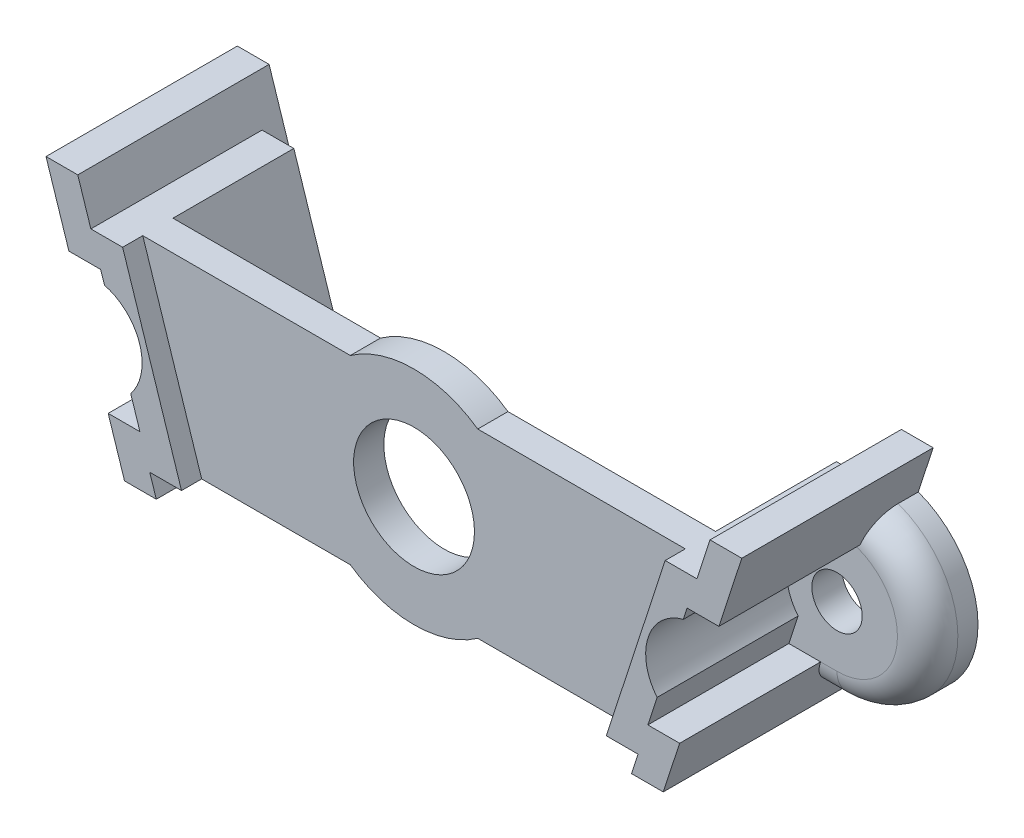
ISO-10303-21;
HEADER;
FILE_DESCRIPTION(('STEP AP214'),'2;1');
FILE_NAME('part.step','',(''),(''),'','','');
FILE_SCHEMA(('AUTOMOTIVE_DESIGN { 1 0 10303 214 1 1 1 1 }'));
ENDSEC;
DATA;
#1=APPLICATION_CONTEXT('core data for automotive mechanical design processes');
#2=APPLICATION_PROTOCOL_DEFINITION('international standard','automotive_design',2000,#1);
#3=PRODUCT_CONTEXT('',#1,'mechanical');
#4=PRODUCT('Part','Part','',(#3));
#5=PRODUCT_RELATED_PRODUCT_CATEGORY('part','',(#4));
#6=PRODUCT_DEFINITION_FORMATION('','',#4);
#7=PRODUCT_DEFINITION_CONTEXT('part definition',#1,'design');
#8=PRODUCT_DEFINITION('design','',#6,#7);
#9=PRODUCT_DEFINITION_SHAPE('','',#8);
#10=(LENGTH_UNIT() NAMED_UNIT(*) SI_UNIT(.MILLI.,.METRE.));
#11=(NAMED_UNIT(*) PLANE_ANGLE_UNIT() SI_UNIT($,.RADIAN.));
#12=(NAMED_UNIT(*) SI_UNIT($,.STERADIAN.) SOLID_ANGLE_UNIT());
#13=UNCERTAINTY_MEASURE_WITH_UNIT(LENGTH_MEASURE(1.E-05),#10,'distance_accuracy_value','');
#14=(GEOMETRIC_REPRESENTATION_CONTEXT(3) GLOBAL_UNCERTAINTY_ASSIGNED_CONTEXT((#13)) GLOBAL_UNIT_ASSIGNED_CONTEXT((#10,
#11,#12)) REPRESENTATION_CONTEXT('',''));
#15=CARTESIAN_POINT('',(0.,0.,0.));
#16=DIRECTION('',(0.,0.,1.));
#17=DIRECTION('',(1.,0.,0.));
#18=AXIS2_PLACEMENT_3D('',#15,#16,#17);
#19=CARTESIAN_POINT('',(-10.0454223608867,4.5,7.50000000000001));
#20=DIRECTION('',(0.951056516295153,0.30901699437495,0.));
#21=DIRECTION('',(-0.30901699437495,0.951056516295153,0.));
#22=AXIS2_PLACEMENT_3D('',#19,#20,#21);
#23=PLANE('',#22);
#24=DIRECTION('',(0.309016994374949,-0.951056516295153,0.));
#25=VECTOR('',#24,1.);
#26=CARTESIAN_POINT('',(-9.55804281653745,3.00000000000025,8.50000000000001));
#27=LINE('',#26,#25);
#28=CARTESIAN_POINT('',(-8.06782683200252,-1.5864132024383,8.50000000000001));
#29=VERTEX_POINT('',#28);
#30=CARTESIAN_POINT('',(-7.60852463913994,-2.99999999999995,8.50000000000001));
#31=VERTEX_POINT('',#30);
#32=EDGE_CURVE('E360',#29,#31,#27,.T.);
#33=ORIENTED_EDGE('',*,*,#32,.F.);
#34=DIRECTION('',(0.,0.,-1.));
#35=VECTOR('',#34,1.);
#36=CARTESIAN_POINT('',(-8.06782683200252,-1.58641320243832,8.50002500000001));
#37=LINE('',#36,#35);
#38=CARTESIAN_POINT('',(-8.06782683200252,-1.58641320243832,1.5));
#39=VERTEX_POINT('',#38);
#40=EDGE_CURVE('E11',#29,#39,#37,.T.);
#41=ORIENTED_EDGE('',*,*,#40,.T.);
#42=DIRECTION('',(0.30901699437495,-0.951056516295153,0.));
#43=VECTOR('',#42,1.);
#44=CARTESIAN_POINT('',(-10.0454223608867,4.5,1.5));
#45=LINE('',#44,#43);
#46=CARTESIAN_POINT('',(-7.60852463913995,-2.99999999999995,1.5));
#47=VERTEX_POINT('',#46);
#48=EDGE_CURVE('E358',#39,#47,#45,.T.);
#49=ORIENTED_EDGE('',*,*,#48,.T.);
#50=DIRECTION('',(0.,0.,1.));
#51=VECTOR('',#50,1.);
#52=CARTESIAN_POINT('',(-7.60852463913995,-2.99999999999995,7.50000000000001));
#53=LINE('',#52,#51);
#54=EDGE_CURVE('E368',#47,#31,#53,.T.);
#55=ORIENTED_EDGE('',*,*,#54,.T.);
#56=EDGE_LOOP('',(#33,#41,#49,#55));
#57=FACE_BOUND('',#56,.T.);
#58=ADVANCED_FACE('F33',(#57),#23,.F.);
#59=CARTESIAN_POINT('',(-10.6952617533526,6.50000000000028,0.));
#60=DIRECTION('',(0.,0.,-1.));
#61=DIRECTION('',(1.,0.,0.));
#62=AXIS2_PLACEMENT_3D('',#59,#60,#61);
#63=PLANE('',#62);
#64=CARTESIAN_POINT('',(-10.,0.,0.));
#65=DIRECTION('',(0.,0.,-1.));
#66=DIRECTION('',(-1.,0.,0.));
#67=AXIS2_PLACEMENT_3D('',#64,#65,#66);
#68=CIRCLE('',#67,1.25);
#69=CARTESIAN_POINT('',(-11.25,0.,0.));
#70=VERTEX_POINT('',#69);
#71=EDGE_CURVE('E1459',#70,#70,#68,.F.);
#72=ORIENTED_EDGE('',*,*,#71,.T.);
#73=EDGE_LOOP('',(#72));
#74=FACE_BOUND('',#73,.T.);
#75=DIRECTION('',(1.,0.,0.));
#76=VECTOR('',#75,1.);
#77=CARTESIAN_POINT('',(-5.54395175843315,-4.50000000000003,0.));
#78=LINE('',#77,#76);
#79=CARTESIAN_POINT('',(-7.12114509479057,-4.49999999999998,0.));
#80=VERTEX_POINT('',#79);
#81=CARTESIAN_POINT('',(-5.54395175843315,-4.50000000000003,0.));
#82=VERTEX_POINT('',#81);
#83=EDGE_CURVE('E393',#80,#82,#78,.T.);
#84=ORIENTED_EDGE('',*,*,#83,.F.);
#85=DIRECTION('',(-0.30901699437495,0.951056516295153,0.));
#86=VECTOR('',#85,1.);
#87=CARTESIAN_POINT('',(-6.79622539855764,-5.50000000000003,0.));
#88=LINE('',#87,#86);
#89=CARTESIAN_POINT('',(-7.60852463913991,-3.00000000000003,0.));
#90=VERTEX_POINT('',#89);
#91=EDGE_CURVE('E370',#80,#90,#88,.T.);
#92=ORIENTED_EDGE('',*,*,#91,.T.);
#93=DIRECTION('',(-1.,0.,0.));
#94=VECTOR('',#93,1.);
#95=CARTESIAN_POINT('',(-10.,-3.00000000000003,0.));
#96=LINE('',#95,#94);
#97=CARTESIAN_POINT('',(-10.,-3.00000000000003,0.));
#98=VERTEX_POINT('',#97);
#99=EDGE_CURVE('E1419',#90,#98,#96,.T.);
#100=ORIENTED_EDGE('',*,*,#99,.T.);
#101=CARTESIAN_POINT('',(-10.,0.,0.));
#102=DIRECTION('',(0.,0.,-1.));
#103=DIRECTION('',(1.,0.,0.));
#104=AXIS2_PLACEMENT_3D('',#101,#102,#103);
#105=CIRCLE('',#104,3.00000000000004);
#106=CARTESIAN_POINT('',(-9.54685899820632,2.96557974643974,0.));
#107=VERTEX_POINT('',#106);
#108=EDGE_CURVE('E1416',#98,#107,#105,.T.);
#109=ORIENTED_EDGE('',*,*,#108,.T.);
#110=DIRECTION('',(-0.30901699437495,0.951056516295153,0.));
#111=VECTOR('',#110,1.);
#112=CARTESIAN_POINT('',(-10.6952617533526,6.50000000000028,0.));
#113=LINE('',#112,#111);
#114=CARTESIAN_POINT('',(-10.0454223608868,4.50000000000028,0.));
#115=VERTEX_POINT('',#114);
#116=EDGE_CURVE('E584',#107,#115,#113,.T.);
#117=ORIENTED_EDGE('',*,*,#116,.T.);
#118=DIRECTION('',(-1.,0.,0.));
#119=VECTOR('',#118,1.);
#120=CARTESIAN_POINT('',(-10.0454223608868,4.50000000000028,0.));
#121=LINE('',#120,#119);
#122=CARTESIAN_POINT('',(-8.46822902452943,4.50000000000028,0.));
#123=VERTEX_POINT('',#122);
#124=EDGE_CURVE('E1400',#123,#115,#121,.T.);
#125=ORIENTED_EDGE('',*,*,#124,.F.);
#126=DIRECTION('',(-0.309016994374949,0.951056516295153,0.));
#127=VECTOR('',#126,1.);
#128=CARTESIAN_POINT('',(-8.46822902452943,4.50000000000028,0.));
#129=LINE('',#128,#127);
#130=EDGE_CURVE('E397',#82,#123,#129,.T.);
#131=ORIENTED_EDGE('',*,*,#130,.F.);
#132=EDGE_LOOP('',(#84,#92,#100,#109,#117,#125,#131));
#133=FACE_BOUND('',#132,.T.);
#134=ADVANCED_FACE('F432',(#74,#133),#63,.T.);
#135=CARTESIAN_POINT('',(-10.,0.,1.5));
#136=DIRECTION('',(0.,0.,1.));
#137=DIRECTION('',(-1.,0.,0.));
#138=AXIS2_PLACEMENT_3D('',#135,#136,#137);
#139=PLANE('',#138);
#140=ORIENTED_EDGE('',*,*,#48,.F.);
#141=CARTESIAN_POINT('',(-10.,0.,1.5));
#142=DIRECTION('',(0.,0.,-1.));
#143=DIRECTION('',(-1.,0.,0.));
#144=AXIS2_PLACEMENT_3D('',#141,#142,#143);
#145=CIRCLE('',#144,2.5);
#146=CARTESIAN_POINT('',(-9.36930935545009,2.41913813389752,1.5));
#147=VERTEX_POINT('',#146);
#148=EDGE_CURVE('E48',#147,#39,#145,.T.);
#149=ORIENTED_EDGE('',*,*,#148,.F.);
#150=CARTESIAN_POINT('',(-9.55804281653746,3.00000000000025,1.5));
#151=VERTEX_POINT('',#150);
#152=EDGE_CURVE('E367',#151,#147,#45,.T.);
#153=ORIENTED_EDGE('',*,*,#152,.F.);
#154=DIRECTION('',(-1.,0.,0.));
#155=VECTOR('',#154,1.);
#156=CARTESIAN_POINT('',(-9.55804281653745,3.00000000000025,1.5));
#157=LINE('',#156,#155);
#158=CARTESIAN_POINT('',(-10.,3.00000000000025,1.5));
#159=VERTEX_POINT('',#158);
#160=EDGE_CURVE('E570',#151,#159,#157,.T.);
#161=ORIENTED_EDGE('',*,*,#160,.T.);
#162=CARTESIAN_POINT('',(-10.,0.,1.5));
#163=DIRECTION('',(0.,0.,1.));
#164=DIRECTION('',(1.,0.,0.));
#165=AXIS2_PLACEMENT_3D('',#162,#163,#164);
#166=CIRCLE('',#165,3.00000000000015);
#167=CARTESIAN_POINT('',(-10.,-3.00000000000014,1.5));
#168=VERTEX_POINT('',#167);
#169=EDGE_CURVE('E383',#159,#168,#166,.T.);
#170=ORIENTED_EDGE('',*,*,#169,.T.);
#171=DIRECTION('',(1.,0.,0.));
#172=VECTOR('',#171,1.);
#173=CARTESIAN_POINT('',(-8.69833843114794,-3.00000000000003,1.5));
#174=LINE('',#173,#172);
#175=CARTESIAN_POINT('',(-9.18571797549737,-2.99999999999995,1.5));
#176=VERTEX_POINT('',#175);
#177=EDGE_CURVE('E401',#168,#176,#174,.T.);
#178=ORIENTED_EDGE('',*,*,#177,.T.);
#179=DIRECTION('',(1.,0.,0.));
#180=VECTOR('',#179,1.);
#181=CARTESIAN_POINT('',(-7.60852463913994,-2.99999999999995,1.5));
#182=LINE('',#181,#180);
#183=EDGE_CURVE('E366',#176,#47,#182,.T.);
#184=ORIENTED_EDGE('',*,*,#183,.T.);
#185=EDGE_LOOP('',(#140,#149,#153,#161,#170,#178,#184));
#186=FACE_BOUND('',#185,.T.);
#187=CARTESIAN_POINT('',(-10.,0.,1.5));
#188=DIRECTION('',(0.,0.,-1.));
#189=DIRECTION('',(-1.,0.,0.));
#190=AXIS2_PLACEMENT_3D('',#187,#188,#189);
#191=CIRCLE('',#190,1.25);
#192=CARTESIAN_POINT('',(-11.25,0.,1.5));
#193=VERTEX_POINT('',#192);
#194=EDGE_CURVE('E1455',#193,#193,#191,.T.);
#195=ORIENTED_EDGE('',*,*,#194,.T.);
#196=EDGE_LOOP('',(#195));
#197=FACE_BOUND('',#196,.T.);
#198=ADVANCED_FACE('F362',(#186,#197),#139,.T.);
#199=CARTESIAN_POINT('',(-9.18571797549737,-2.99999999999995,0.));
#200=DIRECTION('',(-0.951056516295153,-0.309016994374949,0.));
#201=DIRECTION('',(0.309016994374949,-0.951056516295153,0.));
#202=AXIS2_PLACEMENT_3D('',#199,#200,#201);
#203=PLANE('',#202);
#204=DIRECTION('',(0.,0.,1.));
#205=VECTOR('',#204,1.);
#206=CARTESIAN_POINT('',(-9.18571797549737,-2.99999999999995,0.));
#207=LINE('',#206,#205);
#208=CARTESIAN_POINT('',(-9.18571797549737,-2.99999999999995,8.50000000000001));
#209=VERTEX_POINT('',#208);
#210=EDGE_CURVE('E589',#176,#209,#207,.T.);
#211=ORIENTED_EDGE('',*,*,#210,.F.);
#212=CARTESIAN_POINT('',(-9.18571797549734,-3.00000000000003,0.));
#213=DIRECTION('',(-0.951056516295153,-0.309016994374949,0.));
#214=DIRECTION('',(-0.309016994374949,0.951056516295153,0.));
#215=AXIS2_PLACEMENT_3D('',#212,#213,#214);
#216=ELLIPSE('',#215,1.5771933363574,1.5);
#217=CARTESIAN_POINT('',(-8.69833843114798,-4.50000000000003,0.));
#218=VERTEX_POINT('',#217);
#219=EDGE_CURVE('E407',#176,#218,#216,.F.);
#220=ORIENTED_EDGE('',*,*,#219,.T.);
#221=DIRECTION('',(0.,0.,-1.));
#222=VECTOR('',#221,1.);
#223=CARTESIAN_POINT('',(-8.69833843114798,-4.50000000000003,0.));
#224=LINE('',#223,#222);
#225=CARTESIAN_POINT('',(-8.69833843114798,-4.50000000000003,-1.));
#226=VERTEX_POINT('',#225);
#227=EDGE_CURVE('E591',#218,#226,#224,.T.);
#228=ORIENTED_EDGE('',*,*,#227,.T.);
#229=DIRECTION('',(0.309016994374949,-0.951056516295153,0.));
#230=VECTOR('',#229,1.);
#231=CARTESIAN_POINT('',(-8.69833843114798,-4.50000000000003,-1.));
#232=LINE('',#231,#230);
#233=CARTESIAN_POINT('',(-8.37341873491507,-5.50000000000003,-1.));
#234=VERTEX_POINT('',#233);
#235=EDGE_CURVE('E1438',#226,#234,#232,.T.);
#236=ORIENTED_EDGE('',*,*,#235,.T.);
#237=DIRECTION('',(0.,0.,1.));
#238=VECTOR('',#237,1.);
#239=CARTESIAN_POINT('',(-8.37341873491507,-5.50000000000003,0.));
#240=LINE('',#239,#238);
#241=CARTESIAN_POINT('',(-8.37341873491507,-5.50000000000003,8.50000000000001));
#242=VERTEX_POINT('',#241);
#243=EDGE_CURVE('E597',#234,#242,#240,.T.);
#244=ORIENTED_EDGE('',*,*,#243,.T.);
#245=DIRECTION('',(0.309016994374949,-0.951056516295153,0.));
#246=VECTOR('',#245,1.);
#247=CARTESIAN_POINT('',(-9.18571797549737,-2.99999999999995,8.50000000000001));
#248=LINE('',#247,#246);
#249=EDGE_CURVE('E595',#209,#242,#248,.T.);
#250=ORIENTED_EDGE('',*,*,#249,.F.);
#251=EDGE_LOOP('',(#211,#220,#228,#236,#244,#250));
#252=FACE_BOUND('',#251,.T.);
#253=ADVANCED_FACE('F430',(#252),#203,.T.);
#254=CARTESIAN_POINT('',(-11.1352361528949,3.00000000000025,0.));
#255=DIRECTION('',(-0.951056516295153,-0.30901699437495,0.));
#256=DIRECTION('',(0.30901699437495,-0.951056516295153,0.));
#257=AXIS2_PLACEMENT_3D('',#254,#255,#256);
#258=PLANE('',#257);
#259=DIRECTION('',(0.,0.,1.));
#260=VECTOR('',#259,1.);
#261=CARTESIAN_POINT('',(-12.2724550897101,6.50000000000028,0.));
#262=LINE('',#261,#260);
#263=CARTESIAN_POINT('',(-12.2724550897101,6.50000000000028,-1.));
#264=VERTEX_POINT('',#263);
#265=CARTESIAN_POINT('',(-12.2724550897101,6.50000000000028,8.50000000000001));
#266=VERTEX_POINT('',#265);
#267=EDGE_CURVE('E396',#264,#266,#262,.T.);
#268=ORIENTED_EDGE('',*,*,#267,.F.);
#269=DIRECTION('',(0.309016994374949,-0.951056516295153,0.));
#270=VECTOR('',#269,1.);
#271=CARTESIAN_POINT('',(-12.2724550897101,6.50000000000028,-1.));
#272=LINE('',#271,#270);
#273=CARTESIAN_POINT('',(-11.5349293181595,4.23012907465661,-1.));
#274=VERTEX_POINT('',#273);
#275=EDGE_CURVE('E1447',#264,#274,#272,.T.);
#276=ORIENTED_EDGE('',*,*,#275,.T.);
#277=DIRECTION('',(0.,0.,-1.));
#278=VECTOR('',#277,1.);
#279=CARTESIAN_POINT('',(-11.5349293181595,4.23012907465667,1.5));
#280=LINE('',#279,#278);
#281=CARTESIAN_POINT('',(-11.5349293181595,4.23012907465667,0.));
#282=VERTEX_POINT('',#281);
#283=EDGE_CURVE('E1411',#274,#282,#280,.F.);
#284=ORIENTED_EDGE('',*,*,#283,.T.);
#285=CARTESIAN_POINT('',(-11.5349293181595,4.23012907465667,0.));
#286=CARTESIAN_POINT('',(-11.5349292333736,4.23012881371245,0.0421808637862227));
#287=CARTESIAN_POINT('',(-11.5343788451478,4.22843489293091,0.084341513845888));
#288=CARTESIAN_POINT('',(-11.5321831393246,4.22167720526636,0.168361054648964));
#289=CARTESIAN_POINT('',(-11.5305378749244,4.21661360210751,0.210219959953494));
#290=CARTESIAN_POINT('',(-11.5239751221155,4.19641552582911,0.334826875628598));
#291=CARTESIAN_POINT('',(-11.5174306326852,4.17627365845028,0.416740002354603));
#292=CARTESIAN_POINT('',(-11.5001850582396,4.12319723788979,0.575846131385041));
#293=CARTESIAN_POINT('',(-11.4894819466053,4.09025644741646,0.653036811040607));
#294=CARTESIAN_POINT('',(-11.4642259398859,4.01252645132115,0.800499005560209));
#295=CARTESIAN_POINT('',(-11.4496741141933,3.96774053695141,0.870772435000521));
#296=CARTESIAN_POINT('',(-11.4171326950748,3.86758834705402,1.00242254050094));
#297=CARTESIAN_POINT('',(-11.399142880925,3.81222139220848,1.06379864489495));
#298=CARTESIAN_POINT('',(-11.3602246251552,3.69244331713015,1.17594730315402));
#299=CARTESIAN_POINT('',(-11.3392945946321,3.62802730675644,1.226714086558));
#300=CARTESIAN_POINT('',(-11.2950783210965,3.49194360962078,1.31621564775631));
#301=CARTESIAN_POINT('',(-11.2717892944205,3.42026735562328,1.3549359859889));
#302=CARTESIAN_POINT('',(-11.2235567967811,3.27182299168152,1.41912430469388));
#303=CARTESIAN_POINT('',(-11.1986164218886,3.19506441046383,1.44461633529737));
#304=CARTESIAN_POINT('',(-11.1669440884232,3.09758699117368,1.4677435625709));
#305=CARTESIAN_POINT('',(-11.1606300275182,3.07815430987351,1.47190758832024));
#306=CARTESIAN_POINT('',(-11.1479628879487,3.03916886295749,1.47937663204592));
#307=CARTESIAN_POINT('',(-11.141609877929,3.01961630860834,1.48268286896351));
#308=CARTESIAN_POINT('',(-11.1352361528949,3.00000000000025,1.48556323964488));
#309=B_SPLINE_CURVE_WITH_KNOTS('',3,(#285,#286,#287,#288,#289,#290,#291,#292,#293,#294,#295,
#296,#297,#298,#299,#300,#301,#302,#303,#304,#305,#306,#307,#308),.UNSPECIFIED.,.F.,.F.,(4,2,2,
2,2,2,2,2,2,2,2,4),(0.,0.126464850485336,0.252923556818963,0.505441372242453,0.758082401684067,
1.01065330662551,1.26324043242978,1.51596458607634,1.76899051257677,2.02155479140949,
2.08410251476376,2.14656086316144),.UNSPECIFIED.);
#310=CARTESIAN_POINT('',(-11.1352361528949,3.00000000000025,1.48556323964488));
#311=VERTEX_POINT('',#310);
#312=EDGE_CURVE('E409',#282,#311,#309,.T.);
#313=ORIENTED_EDGE('',*,*,#312,.T.);
#314=DIRECTION('',(0.,0.,1.));
#315=VECTOR('',#314,1.);
#316=CARTESIAN_POINT('',(-11.1352361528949,3.00000000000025,0.));
#317=LINE('',#316,#315);
#318=CARTESIAN_POINT('',(-11.1352361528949,3.00000000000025,8.50000000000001));
#319=VERTEX_POINT('',#318);
#320=EDGE_CURVE('E56',#311,#319,#317,.T.);
#321=ORIENTED_EDGE('',*,*,#320,.T.);
#322=DIRECTION('',(0.30901699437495,-0.951056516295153,0.));
#323=VECTOR('',#322,1.);
#324=CARTESIAN_POINT('',(-11.1352361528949,3.00000000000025,8.50000000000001));
#325=LINE('',#324,#323);
#326=EDGE_CURVE('E1397',#266,#319,#325,.T.);
#327=ORIENTED_EDGE('',*,*,#326,.F.);
#328=EDGE_LOOP('',(#268,#276,#284,#313,#321,#327));
#329=FACE_BOUND('',#328,.T.);
#330=ADVANCED_FACE('F425',(#329),#258,.T.);
#331=CARTESIAN_POINT('',(20.6952617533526,6.50000000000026,8.50000000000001));
#332=DIRECTION('',(0.,0.,-1.));
#333=DIRECTION('',(-1.,0.,0.));
#334=AXIS2_PLACEMENT_3D('',#331,#332,#333);
#335=PLANE('',#334);
#336=CARTESIAN_POINT('',(20.,0.,8.50000000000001));
#337=DIRECTION('',(0.,0.,-1.));
#338=DIRECTION('',(-1.,0.,0.));
#339=AXIS2_PLACEMENT_3D('',#336,#337,#338);
#340=CIRCLE('',#339,2.5);
#341=CARTESIAN_POINT('',(19.3693093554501,2.41913813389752,8.50000000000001));
#342=VERTEX_POINT('',#341);
#343=CARTESIAN_POINT('',(18.0678268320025,-1.58641320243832,8.50000000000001));
#344=VERTEX_POINT('',#343);
#345=EDGE_CURVE('E624',#342,#344,#340,.F.);
#346=ORIENTED_EDGE('',*,*,#345,.F.);
#347=DIRECTION('',(-0.309016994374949,-0.951056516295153,0.));
#348=VECTOR('',#347,1.);
#349=CARTESIAN_POINT('',(19.5580428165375,3.00000000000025,8.50000000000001));
#350=LINE('',#349,#348);
#351=CARTESIAN_POINT('',(19.5580428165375,3.00000000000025,8.50000000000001));
#352=VERTEX_POINT('',#351);
#353=EDGE_CURVE('E758',#352,#342,#350,.T.);
#354=ORIENTED_EDGE('',*,*,#353,.F.);
#355=DIRECTION('',(-1.,0.,0.));
#356=VECTOR('',#355,1.);
#357=CARTESIAN_POINT('',(19.5580428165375,3.00000000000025,8.50000000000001));
#358=LINE('',#357,#356);
#359=CARTESIAN_POINT('',(21.1352361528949,3.00000000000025,8.50000000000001));
#360=VERTEX_POINT('',#359);
#361=EDGE_CURVE('E755',#360,#352,#358,.T.);
#362=ORIENTED_EDGE('',*,*,#361,.F.);
#363=DIRECTION('',(-0.30901699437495,-0.951056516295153,0.));
#364=VECTOR('',#363,1.);
#365=CARTESIAN_POINT('',(21.1352361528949,3.00000000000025,8.50000000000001));
#366=LINE('',#365,#364);
#367=CARTESIAN_POINT('',(22.2724550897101,6.50000000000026,8.50000000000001));
#368=VERTEX_POINT('',#367);
#369=EDGE_CURVE('E749',#368,#360,#366,.T.);
#370=ORIENTED_EDGE('',*,*,#369,.F.);
#371=DIRECTION('',(1.,0.,0.));
#372=VECTOR('',#371,1.);
#373=CARTESIAN_POINT('',(20.6952617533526,6.50000000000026,8.50000000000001));
#374=LINE('',#373,#372);
#375=CARTESIAN_POINT('',(20.6952617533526,6.50000000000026,8.50000000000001));
#376=VERTEX_POINT('',#375);
#377=EDGE_CURVE('E745',#376,#368,#374,.T.);
#378=ORIENTED_EDGE('',*,*,#377,.F.);
#379=DIRECTION('',(0.309016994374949,0.951056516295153,0.));
#380=VECTOR('',#379,1.);
#381=CARTESIAN_POINT('',(20.6952617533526,6.50000000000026,8.50000000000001));
#382=LINE('',#381,#380);
#383=CARTESIAN_POINT('',(20.0454223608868,4.50000000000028,8.50000000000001));
#384=VERTEX_POINT('',#383);
#385=EDGE_CURVE('E700',#384,#376,#382,.T.);
#386=ORIENTED_EDGE('',*,*,#385,.F.);
#387=DIRECTION('',(1.,0.,0.));
#388=VECTOR('',#387,1.);
#389=CARTESIAN_POINT('',(20.0454223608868,4.50000000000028,8.50000000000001));
#390=LINE('',#389,#388);
#391=CARTESIAN_POINT('',(18.4682290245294,4.50000000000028,8.50000000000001));
#392=VERTEX_POINT('',#391);
#393=EDGE_CURVE('E777',#392,#384,#390,.T.);
#394=ORIENTED_EDGE('',*,*,#393,.F.);
#395=DIRECTION('',(0.309016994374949,0.951056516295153,0.));
#396=VECTOR('',#395,1.);
#397=CARTESIAN_POINT('',(18.4682290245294,4.50000000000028,8.50000000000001));
#398=LINE('',#397,#396);
#399=CARTESIAN_POINT('',(15.5439517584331,-4.50000000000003,8.50000000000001));
#400=VERTEX_POINT('',#399);
#401=EDGE_CURVE('E774',#400,#392,#398,.T.);
#402=ORIENTED_EDGE('',*,*,#401,.F.);
#403=DIRECTION('',(-1.,0.,0.));
#404=VECTOR('',#403,1.);
#405=CARTESIAN_POINT('',(15.5439517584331,-4.50000000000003,8.50000000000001));
#406=LINE('',#405,#404);
#407=CARTESIAN_POINT('',(17.1211450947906,-4.49999999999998,8.50000000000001));
#408=VERTEX_POINT('',#407);
#409=EDGE_CURVE('E771',#408,#400,#406,.T.);
#410=ORIENTED_EDGE('',*,*,#409,.F.);
#411=DIRECTION('',(0.309016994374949,0.951056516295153,0.));
#412=VECTOR('',#411,1.);
#413=CARTESIAN_POINT('',(17.1211450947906,-4.49999999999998,8.50000000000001));
#414=LINE('',#413,#412);
#415=CARTESIAN_POINT('',(16.7962253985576,-5.50000000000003,8.50000000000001));
#416=VERTEX_POINT('',#415);
#417=EDGE_CURVE('E768',#416,#408,#414,.T.);
#418=ORIENTED_EDGE('',*,*,#417,.F.);
#419=DIRECTION('',(-1.,0.,0.));
#420=VECTOR('',#419,1.);
#421=CARTESIAN_POINT('',(16.7962253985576,-5.50000000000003,8.50000000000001));
#422=LINE('',#421,#420);
#423=CARTESIAN_POINT('',(18.3734187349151,-5.50000000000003,8.50000000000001));
#424=VERTEX_POINT('',#423);
#425=EDGE_CURVE('E766',#424,#416,#422,.T.);
#426=ORIENTED_EDGE('',*,*,#425,.F.);
#427=DIRECTION('',(-0.309016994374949,-0.951056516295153,0.));
#428=VECTOR('',#427,1.);
#429=CARTESIAN_POINT('',(19.1857179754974,-2.99999999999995,8.50000000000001));
#430=LINE('',#429,#428);
#431=CARTESIAN_POINT('',(19.1857179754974,-2.99999999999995,8.50000000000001));
#432=VERTEX_POINT('',#431);
#433=EDGE_CURVE('E764',#432,#424,#430,.T.);
#434=ORIENTED_EDGE('',*,*,#433,.F.);
#435=DIRECTION('',(1.,0.,0.));
#436=VECTOR('',#435,1.);
#437=CARTESIAN_POINT('',(17.6085246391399,-2.99999999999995,8.50000000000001));
#438=LINE('',#437,#436);
#439=CARTESIAN_POINT('',(17.6085246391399,-2.99999999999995,8.50000000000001));
#440=VERTEX_POINT('',#439);
#441=EDGE_CURVE('E761',#440,#432,#438,.T.);
#442=ORIENTED_EDGE('',*,*,#441,.F.);
#443=EDGE_CURVE('E757',#344,#440,#350,.T.);
#444=ORIENTED_EDGE('',*,*,#443,.F.);
#445=EDGE_LOOP('',(#346,#354,#362,#370,#378,#386,#394,#402,#410,#418,#426,#434,#442,#444));
#446=FACE_BOUND('',#445,.T.);
#447=ADVANCED_FACE('F429',(#446),#335,.F.);
#448=CARTESIAN_POINT('',(17.1211450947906,-4.49999999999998,7.50000000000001));
#449=DIRECTION('',(-0.951056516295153,0.309016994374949,0.));
#450=DIRECTION('',(-0.309016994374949,-0.951056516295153,0.));
#451=AXIS2_PLACEMENT_3D('',#448,#449,#450);
#452=PLANE('',#451);
#453=DIRECTION('',(0.,0.,-1.));
#454=VECTOR('',#453,1.);
#455=CARTESIAN_POINT('',(19.3693093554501,2.41913813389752,8.50002500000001));
#456=LINE('',#455,#454);
#457=CARTESIAN_POINT('',(19.3693093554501,2.41913813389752,1.5));
#458=VERTEX_POINT('',#457);
#459=EDGE_CURVE('E626',#458,#342,#456,.F.);
#460=ORIENTED_EDGE('',*,*,#459,.F.);
#461=DIRECTION('',(0.309016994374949,0.951056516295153,0.));
#462=VECTOR('',#461,1.);
#463=CARTESIAN_POINT('',(17.1211450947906,-4.49999999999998,1.5));
#464=LINE('',#463,#462);
#465=CARTESIAN_POINT('',(19.5580428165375,3.00000000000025,1.5));
#466=VERTEX_POINT('',#465);
#467=EDGE_CURVE('E853',#458,#466,#464,.T.);
#468=ORIENTED_EDGE('',*,*,#467,.T.);
#469=DIRECTION('',(0.,0.,-1.));
#470=VECTOR('',#469,1.);
#471=CARTESIAN_POINT('',(19.5580428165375,3.00000000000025,7.50000000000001));
#472=LINE('',#471,#470);
#473=EDGE_CURVE('E852',#352,#466,#472,.T.);
#474=ORIENTED_EDGE('',*,*,#473,.F.);
#475=ORIENTED_EDGE('',*,*,#353,.T.);
#476=EDGE_LOOP('',(#460,#468,#474,#475));
#477=FACE_BOUND('',#476,.T.);
#478=ADVANCED_FACE('F536',(#477),#452,.F.);
#479=DIRECTION('',(0.,0.,-1.));
#480=VECTOR('',#479,1.);
#481=CARTESIAN_POINT('',(18.0678268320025,-1.58641320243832,8.50002500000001));
#482=LINE('',#481,#480);
#483=CARTESIAN_POINT('',(18.0678268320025,-1.58641320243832,1.5));
#484=VERTEX_POINT('',#483);
#485=EDGE_CURVE('E621',#344,#484,#482,.T.);
#486=ORIENTED_EDGE('',*,*,#485,.F.);
#487=ORIENTED_EDGE('',*,*,#443,.T.);
#488=DIRECTION('',(0.,0.,1.));
#489=VECTOR('',#488,1.);
#490=CARTESIAN_POINT('',(17.6085246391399,-2.99999999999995,7.50000000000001));
#491=LINE('',#490,#489);
#492=CARTESIAN_POINT('',(17.6085246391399,-2.99999999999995,1.5));
#493=VERTEX_POINT('',#492);
#494=EDGE_CURVE('E389',#493,#440,#491,.T.);
#495=ORIENTED_EDGE('',*,*,#494,.F.);
#496=EDGE_CURVE('E682',#493,#484,#464,.T.);
#497=ORIENTED_EDGE('',*,*,#496,.T.);
#498=EDGE_LOOP('',(#486,#487,#495,#497));
#499=FACE_BOUND('',#498,.T.);
#500=ADVANCED_FACE('F522',(#499),#452,.F.);
#501=CARTESIAN_POINT('',(5.,0.,7.50000000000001));
#502=DIRECTION('',(0.,0.,1.));
#503=DIRECTION('',(1.,0.,0.));
#504=AXIS2_PLACEMENT_3D('',#501,#502,#503);
#505=PLANE('',#504);
#506=DIRECTION('',(-0.309016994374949,0.951056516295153,0.));
#507=VECTOR('',#506,1.);
#508=CARTESIAN_POINT('',(-5.85961077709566,-3.52850143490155,7.50000000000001));
#509=LINE('',#508,#507);
#510=CARTESIAN_POINT('',(-5.54395175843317,-4.49999999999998,7.50000000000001));
#511=VERTEX_POINT('',#510);
#512=CARTESIAN_POINT('',(-8.46822902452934,4.50000000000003,7.50000000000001));
#513=VERTEX_POINT('',#512);
#514=EDGE_CURVE('E616',#511,#513,#509,.T.);
#515=ORIENTED_EDGE('',*,*,#514,.F.);
#516=DIRECTION('',(1.,-1.84821750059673E-13,0.));
#517=VECTOR('',#516,1.);
#518=CARTESIAN_POINT('',(1.83772233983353,-4.50000000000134,7.50000000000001));
#519=LINE('',#518,#517);
#520=CARTESIAN_POINT('',(1.83772233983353,-4.50000000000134,7.50000000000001));
#521=VERTEX_POINT('',#520);
#522=EDGE_CURVE('E828',#511,#521,#519,.T.);
#523=ORIENTED_EDGE('',*,*,#522,.T.);
#524=CARTESIAN_POINT('',(5.,0.,7.50000000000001));
#525=DIRECTION('',(0.,0.,1.));
#526=DIRECTION('',(1.,0.,0.));
#527=AXIS2_PLACEMENT_3D('',#524,#525,#526);
#528=CIRCLE('',#527,5.5);
#529=CARTESIAN_POINT('',(8.16227766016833,-4.50000000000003,7.50000000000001));
#530=VERTEX_POINT('',#529);
#531=EDGE_CURVE('E830',#521,#530,#528,.T.);
#532=ORIENTED_EDGE('',*,*,#531,.T.);
#533=DIRECTION('',(1.,0.,0.));
#534=VECTOR('',#533,1.);
#535=CARTESIAN_POINT('',(17.1211450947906,-4.49999999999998,7.50000000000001));
#536=LINE('',#535,#534);
#537=CARTESIAN_POINT('',(15.5439517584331,-4.50000000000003,7.50000000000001));
#538=VERTEX_POINT('',#537);
#539=EDGE_CURVE('E832',#530,#538,#536,.T.);
#540=ORIENTED_EDGE('',*,*,#539,.T.);
#541=DIRECTION('',(0.309016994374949,0.951056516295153,0.));
#542=VECTOR('',#541,1.);
#543=CARTESIAN_POINT('',(15.8596107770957,-3.52850143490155,7.50000000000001));
#544=LINE('',#543,#542);
#545=CARTESIAN_POINT('',(18.4682290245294,4.50000000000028,7.50000000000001));
#546=VERTEX_POINT('',#545);
#547=EDGE_CURVE('E805',#538,#546,#544,.T.);
#548=ORIENTED_EDGE('',*,*,#547,.T.);
#549=DIRECTION('',(-1.,0.,0.));
#550=VECTOR('',#549,1.);
#551=CARTESIAN_POINT('',(20.0454223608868,4.50000000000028,7.50000000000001));
#552=LINE('',#551,#550);
#553=CARTESIAN_POINT('',(8.16227766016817,4.50000000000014,7.50000000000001));
#554=VERTEX_POINT('',#553);
#555=EDGE_CURVE('E835',#546,#554,#552,.T.);
#556=ORIENTED_EDGE('',*,*,#555,.T.);
#557=CARTESIAN_POINT('',(5.,0.,7.50000000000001));
#558=DIRECTION('',(0.,0.,1.));
#559=DIRECTION('',(1.,0.,0.));
#560=AXIS2_PLACEMENT_3D('',#557,#558,#559);
#561=CIRCLE('',#560,5.5);
#562=CARTESIAN_POINT('',(1.83772233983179,4.50000000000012,7.50000000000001));
#563=VERTEX_POINT('',#562);
#564=EDGE_CURVE('E837',#554,#563,#561,.T.);
#565=ORIENTED_EDGE('',*,*,#564,.T.);
#566=DIRECTION('',(-1.,0.,0.));
#567=VECTOR('',#566,1.);
#568=CARTESIAN_POINT('',(1.83772233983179,4.50000000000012,7.50000000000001));
#569=LINE('',#568,#567);
#570=EDGE_CURVE('E839',#563,#513,#569,.T.);
#571=ORIENTED_EDGE('',*,*,#570,.T.);
#572=EDGE_LOOP('',(#515,#523,#532,#540,#548,#556,#565,#571));
#573=FACE_BOUND('',#572,.T.);
#574=CARTESIAN_POINT('',(5.,0.,7.50000000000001));
#575=DIRECTION('',(0.,0.,1.));
#576=DIRECTION('',(1.,0.,0.));
#577=AXIS2_PLACEMENT_3D('',#574,#575,#576);
#578=CIRCLE('',#577,3.);
#579=CARTESIAN_POINT('',(8.,0.,7.50000000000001));
#580=VERTEX_POINT('',#579);
#581=EDGE_CURVE('E811',#580,#580,#578,.T.);
#582=ORIENTED_EDGE('',*,*,#581,.F.);
#583=EDGE_LOOP('',(#582));
#584=FACE_BOUND('',#583,.T.);
#585=ADVANCED_FACE('F518',(#573,#584),#505,.T.);
#586=CARTESIAN_POINT('',(5.,0.,6.00000000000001));
#587=DIRECTION('',(0.,0.,1.));
#588=DIRECTION('',(1.,0.,0.));
#589=AXIS2_PLACEMENT_3D('',#586,#587,#588);
#590=PLANE('',#589);
#591=CARTESIAN_POINT('',(5.,0.,6.00000000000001));
#592=DIRECTION('',(0.,0.,1.));
#593=DIRECTION('',(1.,0.,0.));
#594=AXIS2_PLACEMENT_3D('',#591,#592,#593);
#595=CIRCLE('',#594,3.);
#596=CARTESIAN_POINT('',(8.,0.,6.00000000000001));
#597=VERTEX_POINT('',#596);
#598=EDGE_CURVE('E808',#597,#597,#595,.T.);
#599=ORIENTED_EDGE('',*,*,#598,.T.);
#600=EDGE_LOOP('',(#599));
#601=FACE_BOUND('',#600,.T.);
#602=DIRECTION('',(1.,-1.84821750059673E-13,0.));
#603=VECTOR('',#602,1.);
#604=CARTESIAN_POINT('',(1.83772233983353,-4.50000000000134,6.00000000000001));
#605=LINE('',#604,#603);
#606=CARTESIAN_POINT('',(-5.54395175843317,-4.49999999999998,6.00000000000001));
#607=VERTEX_POINT('',#606);
#608=CARTESIAN_POINT('',(1.83772233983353,-4.50000000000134,6.00000000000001));
#609=VERTEX_POINT('',#608);
#610=EDGE_CURVE('E814',#607,#609,#605,.T.);
#611=ORIENTED_EDGE('',*,*,#610,.F.);
#612=DIRECTION('',(-0.309016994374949,0.951056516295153,0.));
#613=VECTOR('',#612,1.);
#614=CARTESIAN_POINT('',(-5.85961077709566,-3.52850143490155,6.00000000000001));
#615=LINE('',#614,#613);
#616=CARTESIAN_POINT('',(-8.46822902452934,4.50000000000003,6.00000000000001));
#617=VERTEX_POINT('',#616);
#618=EDGE_CURVE('E613',#607,#617,#615,.T.);
#619=ORIENTED_EDGE('',*,*,#618,.T.);
#620=DIRECTION('',(-1.,0.,0.));
#621=VECTOR('',#620,1.);
#622=CARTESIAN_POINT('',(1.83772233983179,4.50000000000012,6.00000000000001));
#623=LINE('',#622,#621);
#624=CARTESIAN_POINT('',(1.83772233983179,4.50000000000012,6.00000000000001));
#625=VERTEX_POINT('',#624);
#626=EDGE_CURVE('E825',#625,#617,#623,.T.);
#627=ORIENTED_EDGE('',*,*,#626,.F.);
#628=CARTESIAN_POINT('',(5.,0.,6.00000000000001));
#629=DIRECTION('',(0.,0.,1.));
#630=DIRECTION('',(1.,0.,0.));
#631=AXIS2_PLACEMENT_3D('',#628,#629,#630);
#632=CIRCLE('',#631,5.5);
#633=CARTESIAN_POINT('',(8.16227766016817,4.50000000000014,6.00000000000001));
#634=VERTEX_POINT('',#633);
#635=EDGE_CURVE('E823',#634,#625,#632,.T.);
#636=ORIENTED_EDGE('',*,*,#635,.F.);
#637=DIRECTION('',(-1.,0.,0.));
#638=VECTOR('',#637,1.);
#639=CARTESIAN_POINT('',(20.0454223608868,4.50000000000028,6.00000000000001));
#640=LINE('',#639,#638);
#641=CARTESIAN_POINT('',(18.4682290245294,4.50000000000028,6.00000000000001));
#642=VERTEX_POINT('',#641);
#643=EDGE_CURVE('E821',#642,#634,#640,.T.);
#644=ORIENTED_EDGE('',*,*,#643,.F.);
#645=DIRECTION('',(0.309016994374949,0.951056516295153,0.));
#646=VECTOR('',#645,1.);
#647=CARTESIAN_POINT('',(15.8596107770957,-3.52850143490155,6.00000000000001));
#648=LINE('',#647,#646);
#649=CARTESIAN_POINT('',(15.5439517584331,-4.50000000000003,6.00000000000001));
#650=VERTEX_POINT('',#649);
#651=EDGE_CURVE('E802',#650,#642,#648,.T.);
#652=ORIENTED_EDGE('',*,*,#651,.F.);
#653=DIRECTION('',(1.,0.,0.));
#654=VECTOR('',#653,1.);
#655=CARTESIAN_POINT('',(17.1211450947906,-4.49999999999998,6.00000000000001));
#656=LINE('',#655,#654);
#657=CARTESIAN_POINT('',(8.16227766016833,-4.50000000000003,6.00000000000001));
#658=VERTEX_POINT('',#657);
#659=EDGE_CURVE('E818',#658,#650,#656,.T.);
#660=ORIENTED_EDGE('',*,*,#659,.F.);
#661=CARTESIAN_POINT('',(5.,0.,6.00000000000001));
#662=DIRECTION('',(0.,0.,1.));
#663=DIRECTION('',(1.,0.,0.));
#664=AXIS2_PLACEMENT_3D('',#661,#662,#663);
#665=CIRCLE('',#664,5.5);
#666=EDGE_CURVE('E816',#609,#658,#665,.T.);
#667=ORIENTED_EDGE('',*,*,#666,.F.);
#668=EDGE_LOOP('',(#611,#619,#627,#636,#644,#652,#660,#667));
#669=FACE_BOUND('',#668,.T.);
#670=ADVANCED_FACE('F514',(#601,#669),#590,.F.);
#671=CARTESIAN_POINT('',(1.83772233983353,-4.50000000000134,7.50000000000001));
#672=DIRECTION('',(1.84821750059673E-13,1.,0.));
#673=DIRECTION('',(-1.,1.84821750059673E-13,0.));
#674=AXIS2_PLACEMENT_3D('',#671,#672,#673);
#675=PLANE('',#674);
#676=DIRECTION('',(0.,0.,-1.));
#677=VECTOR('',#676,1.);
#678=CARTESIAN_POINT('',(-7.12114509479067,-4.4999999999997,7.50000000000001));
#679=LINE('',#678,#677);
#680=CARTESIAN_POINT('',(-7.12114509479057,-4.49999999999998,8.50000000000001));
#681=VERTEX_POINT('',#680);
#682=EDGE_CURVE('E386',#681,#80,#679,.T.);
#683=ORIENTED_EDGE('',*,*,#682,.T.);
#684=ORIENTED_EDGE('',*,*,#83,.T.);
#685=DIRECTION('',(0.,0.,1.));
#686=VECTOR('',#685,1.);
#687=CARTESIAN_POINT('',(-5.54395175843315,-4.50000000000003,0.));
#688=LINE('',#687,#686);
#689=EDGE_CURVE('E606',#82,#607,#688,.T.);
#690=ORIENTED_EDGE('',*,*,#689,.T.);
#691=ORIENTED_EDGE('',*,*,#610,.T.);
#692=DIRECTION('',(0.,0.,-1.));
#693=VECTOR('',#692,1.);
#694=CARTESIAN_POINT('',(1.83772233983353,-4.50000000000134,7.50000000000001));
#695=LINE('',#694,#693);
#696=EDGE_CURVE('E390',#521,#609,#695,.T.);
#697=ORIENTED_EDGE('',*,*,#696,.F.);
#698=ORIENTED_EDGE('',*,*,#522,.F.);
#699=CARTESIAN_POINT('',(-5.54395175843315,-4.50000000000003,8.50000000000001));
#700=VERTEX_POINT('',#699);
#701=EDGE_CURVE('E605',#511,#700,#688,.T.);
#702=ORIENTED_EDGE('',*,*,#701,.T.);
#703=DIRECTION('',(1.,0.,0.));
#704=VECTOR('',#703,1.);
#705=CARTESIAN_POINT('',(-5.54395175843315,-4.50000000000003,8.50000000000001));
#706=LINE('',#705,#704);
#707=EDGE_CURVE('E1379',#681,#700,#706,.T.);
#708=ORIENTED_EDGE('',*,*,#707,.F.);
#709=EDGE_LOOP('',(#683,#684,#690,#691,#697,#698,#702,#708));
#710=FACE_BOUND('',#709,.T.);
#711=ADVANCED_FACE('F517',(#710),#675,.F.);
#712=CARTESIAN_POINT('',(5.,0.,7.50000000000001));
#713=DIRECTION('',(0.,0.,-1.));
#714=DIRECTION('',(-1.,0.,0.));
#715=AXIS2_PLACEMENT_3D('',#712,#713,#714);
#716=CYLINDRICAL_SURFACE('',#715,5.5);
#717=ORIENTED_EDGE('',*,*,#666,.T.);
#718=DIRECTION('',(0.,0.,-1.));
#719=VECTOR('',#718,1.);
#720=CARTESIAN_POINT('',(8.16227766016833,-4.50000000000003,7.50000000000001));
#721=LINE('',#720,#719);
#722=EDGE_CURVE('E693',#530,#658,#721,.T.);
#723=ORIENTED_EDGE('',*,*,#722,.F.);
#724=ORIENTED_EDGE('',*,*,#531,.F.);
#725=ORIENTED_EDGE('',*,*,#696,.T.);
#726=EDGE_LOOP('',(#717,#723,#724,#725));
#727=FACE_BOUND('',#726,.T.);
#728=ADVANCED_FACE('F542',(#727),#716,.T.);
#729=CARTESIAN_POINT('',(17.1211450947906,-4.49999999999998,7.50000000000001));
#730=DIRECTION('',(0.,1.,0.));
#731=DIRECTION('',(-1.,0.,0.));
#732=AXIS2_PLACEMENT_3D('',#729,#730,#731);
#733=PLANE('',#732);
#734=ORIENTED_EDGE('',*,*,#659,.T.);
#735=DIRECTION('',(0.,0.,1.));
#736=VECTOR('',#735,1.);
#737=CARTESIAN_POINT('',(15.5439517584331,-4.50000000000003,0.));
#738=LINE('',#737,#736);
#739=CARTESIAN_POINT('',(15.5439517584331,-4.50000000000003,0.));
#740=VERTEX_POINT('',#739);
#741=EDGE_CURVE('E788',#740,#650,#738,.T.);
#742=ORIENTED_EDGE('',*,*,#741,.F.);
#743=DIRECTION('',(-1.,0.,0.));
#744=VECTOR('',#743,1.);
#745=CARTESIAN_POINT('',(15.5439517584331,-4.50000000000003,0.));
#746=LINE('',#745,#744);
#747=CARTESIAN_POINT('',(17.1211450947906,-4.49999999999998,0.));
#748=VERTEX_POINT('',#747);
#749=EDGE_CURVE('E697',#748,#740,#746,.T.);
#750=ORIENTED_EDGE('',*,*,#749,.F.);
#751=DIRECTION('',(0.,0.,-1.));
#752=VECTOR('',#751,1.);
#753=CARTESIAN_POINT('',(17.1211450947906,-4.49999999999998,7.50000000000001));
#754=LINE('',#753,#752);
#755=EDGE_CURVE('E690',#408,#748,#754,.T.);
#756=ORIENTED_EDGE('',*,*,#755,.F.);
#757=ORIENTED_EDGE('',*,*,#409,.T.);
#758=EDGE_CURVE('E787',#538,#400,#738,.T.);
#759=ORIENTED_EDGE('',*,*,#758,.F.);
#760=ORIENTED_EDGE('',*,*,#539,.F.);
#761=ORIENTED_EDGE('',*,*,#722,.T.);
#762=EDGE_LOOP('',(#734,#742,#750,#756,#757,#759,#760,#761));
#763=FACE_BOUND('',#762,.T.);
#764=ADVANCED_FACE('F534',(#763),#733,.F.);
#765=CARTESIAN_POINT('',(20.0454223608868,4.50000000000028,7.50000000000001));
#766=DIRECTION('',(0.,-1.,0.));
#767=DIRECTION('',(1.,0.,0.));
#768=AXIS2_PLACEMENT_3D('',#765,#766,#767);
#769=PLANE('',#768);
#770=DIRECTION('',(0.,0.,-1.));
#771=VECTOR('',#770,1.);
#772=CARTESIAN_POINT('',(20.0454223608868,4.50000000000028,7.50000000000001));
#773=LINE('',#772,#771);
#774=CARTESIAN_POINT('',(20.0454223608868,4.50000000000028,0.));
#775=VERTEX_POINT('',#774);
#776=EDGE_CURVE('E694',#384,#775,#773,.T.);
#777=ORIENTED_EDGE('',*,*,#776,.T.);
#778=DIRECTION('',(1.,0.,0.));
#779=VECTOR('',#778,1.);
#780=CARTESIAN_POINT('',(20.0454223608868,4.50000000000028,0.));
#781=LINE('',#780,#779);
#782=CARTESIAN_POINT('',(18.4682290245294,4.50000000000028,0.));
#783=VERTEX_POINT('',#782);
#784=EDGE_CURVE('E703',#783,#775,#781,.T.);
#785=ORIENTED_EDGE('',*,*,#784,.F.);
#786=DIRECTION('',(0.,0.,1.));
#787=VECTOR('',#786,1.);
#788=CARTESIAN_POINT('',(18.4682290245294,4.50000000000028,0.));
#789=LINE('',#788,#787);
#790=EDGE_CURVE('E785',#783,#642,#789,.T.);
#791=ORIENTED_EDGE('',*,*,#790,.T.);
#792=ORIENTED_EDGE('',*,*,#643,.T.);
#793=DIRECTION('',(0.,0.,-1.));
#794=VECTOR('',#793,1.);
#795=CARTESIAN_POINT('',(8.16227766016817,4.50000000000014,7.50000000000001));
#796=LINE('',#795,#794);
#797=EDGE_CURVE('E710',#554,#634,#796,.T.);
#798=ORIENTED_EDGE('',*,*,#797,.F.);
#799=ORIENTED_EDGE('',*,*,#555,.F.);
#800=EDGE_CURVE('E784',#546,#392,#789,.T.);
#801=ORIENTED_EDGE('',*,*,#800,.T.);
#802=ORIENTED_EDGE('',*,*,#393,.T.);
#803=EDGE_LOOP('',(#777,#785,#791,#792,#798,#799,#801,#802));
#804=FACE_BOUND('',#803,.T.);
#805=ADVANCED_FACE('F530',(#804),#769,.F.);
#806=CARTESIAN_POINT('',(5.,0.,7.50000000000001));
#807=DIRECTION('',(0.,0.,-1.));
#808=DIRECTION('',(-1.,0.,0.));
#809=AXIS2_PLACEMENT_3D('',#806,#807,#808);
#810=CYLINDRICAL_SURFACE('',#809,5.5);
#811=ORIENTED_EDGE('',*,*,#635,.T.);
#812=DIRECTION('',(0.,0.,-1.));
#813=VECTOR('',#812,1.);
#814=CARTESIAN_POINT('',(1.83772233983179,4.50000000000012,7.50000000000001));
#815=LINE('',#814,#813);
#816=EDGE_CURVE('E842',#563,#625,#815,.T.);
#817=ORIENTED_EDGE('',*,*,#816,.F.);
#818=ORIENTED_EDGE('',*,*,#564,.F.);
#819=ORIENTED_EDGE('',*,*,#797,.T.);
#820=EDGE_LOOP('',(#811,#817,#818,#819));
#821=FACE_BOUND('',#820,.T.);
#822=ADVANCED_FACE('F526',(#821),#810,.T.);
#823=CARTESIAN_POINT('',(1.83772233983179,4.50000000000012,7.50000000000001));
#824=DIRECTION('',(0.,-1.,0.));
#825=DIRECTION('',(1.,0.,0.));
#826=AXIS2_PLACEMENT_3D('',#823,#824,#825);
#827=PLANE('',#826);
#828=ORIENTED_EDGE('',*,*,#124,.T.);
#829=DIRECTION('',(0.,0.,-1.));
#830=VECTOR('',#829,1.);
#831=CARTESIAN_POINT('',(-10.0454223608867,4.5,7.50000000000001));
#832=LINE('',#831,#830);
#833=CARTESIAN_POINT('',(-10.0454223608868,4.50000000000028,8.50000000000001));
#834=VERTEX_POINT('',#833);
#835=EDGE_CURVE('E841',#834,#115,#832,.T.);
#836=ORIENTED_EDGE('',*,*,#835,.F.);
#837=DIRECTION('',(-1.,0.,0.));
#838=VECTOR('',#837,1.);
#839=CARTESIAN_POINT('',(-10.0454223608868,4.50000000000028,8.50000000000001));
#840=LINE('',#839,#838);
#841=CARTESIAN_POINT('',(-8.46822902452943,4.50000000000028,8.50000000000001));
#842=VERTEX_POINT('',#841);
#843=EDGE_CURVE('E1368',#842,#834,#840,.T.);
#844=ORIENTED_EDGE('',*,*,#843,.F.);
#845=DIRECTION('',(0.,0.,1.));
#846=VECTOR('',#845,1.);
#847=CARTESIAN_POINT('',(-8.46822902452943,4.50000000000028,0.));
#848=LINE('',#847,#846);
#849=EDGE_CURVE('E608',#513,#842,#848,.T.);
#850=ORIENTED_EDGE('',*,*,#849,.F.);
#851=ORIENTED_EDGE('',*,*,#570,.F.);
#852=ORIENTED_EDGE('',*,*,#816,.T.);
#853=ORIENTED_EDGE('',*,*,#626,.T.);
#854=EDGE_CURVE('E609',#123,#617,#848,.T.);
#855=ORIENTED_EDGE('',*,*,#854,.F.);
#856=EDGE_LOOP('',(#828,#836,#844,#850,#851,#852,#853,#855));
#857=FACE_BOUND('',#856,.T.);
#858=ADVANCED_FACE('F512',(#857),#827,.F.);
#859=CARTESIAN_POINT('',(5.,0.,7.50000000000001));
#860=DIRECTION('',(0.,0.,-1.));
#861=DIRECTION('',(-1.,0.,0.));
#862=AXIS2_PLACEMENT_3D('',#859,#860,#861);
#863=CYLINDRICAL_SURFACE('',#862,3.);
#864=ORIENTED_EDGE('',*,*,#581,.T.);
#865=EDGE_LOOP('',(#864));
#866=FACE_BOUND('',#865,.T.);
#867=ORIENTED_EDGE('',*,*,#598,.F.);
#868=EDGE_LOOP('',(#867));
#869=FACE_BOUND('',#868,.T.);
#870=ADVANCED_FACE('F509',(#866,#869),#863,.F.);
#871=CARTESIAN_POINT('',(18.4682290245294,4.50000000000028,0.));
#872=DIRECTION('',(0.951056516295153,-0.309016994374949,0.));
#873=DIRECTION('',(0.309016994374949,0.951056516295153,0.));
#874=AXIS2_PLACEMENT_3D('',#871,#872,#873);
#875=PLANE('',#874);
#876=ORIENTED_EDGE('',*,*,#651,.T.);
#877=ORIENTED_EDGE('',*,*,#790,.F.);
#878=DIRECTION('',(0.309016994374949,0.951056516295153,0.));
#879=VECTOR('',#878,1.);
#880=CARTESIAN_POINT('',(18.4682290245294,4.50000000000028,0.));
#881=LINE('',#880,#879);
#882=EDGE_CURVE('E699',#740,#783,#881,.T.);
#883=ORIENTED_EDGE('',*,*,#882,.F.);
#884=ORIENTED_EDGE('',*,*,#741,.T.);
#885=EDGE_LOOP('',(#876,#877,#883,#884));
#886=FACE_BOUND('',#885,.T.);
#887=ADVANCED_FACE('F507',(#886),#875,.F.);
#888=CARTESIAN_POINT('',(20.6952617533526,6.50000000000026,0.));
#889=DIRECTION('',(0.,-1.,0.));
#890=DIRECTION('',(0.,0.,-1.));
#891=AXIS2_PLACEMENT_3D('',#888,#889,#890);
#892=PLANE('',#891);
#893=ORIENTED_EDGE('',*,*,#377,.T.);
#894=DIRECTION('',(0.,0.,1.));
#895=VECTOR('',#894,1.);
#896=CARTESIAN_POINT('',(22.2724550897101,6.50000000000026,0.));
#897=LINE('',#896,#895);
#898=CARTESIAN_POINT('',(22.2724550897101,6.50000000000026,-1.));
#899=VERTEX_POINT('',#898);
#900=EDGE_CURVE('E799',#899,#368,#897,.T.);
#901=ORIENTED_EDGE('',*,*,#900,.F.);
#902=DIRECTION('',(1.,0.,0.));
#903=VECTOR('',#902,1.);
#904=CARTESIAN_POINT('',(20.6952617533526,6.50000000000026,-1.));
#905=LINE('',#904,#903);
#906=CARTESIAN_POINT('',(20.6952617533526,6.50000000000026,-1.));
#907=VERTEX_POINT('',#906);
#908=EDGE_CURVE('E638',#907,#899,#905,.T.);
#909=ORIENTED_EDGE('',*,*,#908,.F.);
#910=DIRECTION('',(0.,0.,1.));
#911=VECTOR('',#910,1.);
#912=CARTESIAN_POINT('',(20.6952617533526,6.50000000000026,0.));
#913=LINE('',#912,#911);
#914=EDGE_CURVE('E705',#907,#376,#913,.T.);
#915=ORIENTED_EDGE('',*,*,#914,.T.);
#916=EDGE_LOOP('',(#893,#901,#909,#915));
#917=FACE_BOUND('',#916,.T.);
#918=ADVANCED_FACE('F501',(#917),#892,.F.);
#919=CARTESIAN_POINT('',(21.1352361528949,3.00000000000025,0.));
#920=DIRECTION('',(-0.951056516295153,0.30901699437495,0.));
#921=DIRECTION('',(-0.30901699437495,-0.951056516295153,0.));
#922=AXIS2_PLACEMENT_3D('',#919,#920,#921);
#923=PLANE('',#922);
#924=DIRECTION('',(0.,0.,1.));
#925=VECTOR('',#924,1.);
#926=CARTESIAN_POINT('',(21.1352361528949,3.00000000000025,0.));
#927=LINE('',#926,#925);
#928=CARTESIAN_POINT('',(21.1352361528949,3.00000000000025,1.48556323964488));
#929=VERTEX_POINT('',#928);
#930=EDGE_CURVE('E731',#929,#360,#927,.T.);
#931=ORIENTED_EDGE('',*,*,#930,.F.);
#932=CARTESIAN_POINT('',(21.1352361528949,3.00000000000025,1.48556323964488));
#933=CARTESIAN_POINT('',(21.1481665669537,3.03979572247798,1.47972185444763));
#934=CARTESIAN_POINT('',(21.1610146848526,3.07933816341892,1.47211845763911));
#935=CARTESIAN_POINT('',(21.1864671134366,3.15767268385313,1.45344077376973));
#936=CARTESIAN_POINT('',(21.1990714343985,3.19646479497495,1.44236663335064));
#937=CARTESIAN_POINT('',(21.2363633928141,3.3112376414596,1.40405599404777));
#938=CARTESIAN_POINT('',(21.2605701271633,3.38573830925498,1.37171303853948));
#939=CARTESIAN_POINT('',(21.3069616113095,3.52851661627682,1.29433030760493));
#940=CARTESIAN_POINT('',(21.3291453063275,3.59679100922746,1.24928395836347));
#941=CARTESIAN_POINT('',(21.3708555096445,3.72516181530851,1.14777922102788));
#942=CARTESIAN_POINT('',(21.3903827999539,3.78526063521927,1.09132420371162));
#943=CARTESIAN_POINT('',(21.4262121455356,3.89553202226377,0.968651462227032));
#944=CARTESIAN_POINT('',(21.4425168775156,3.94571282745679,0.90244192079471));
#945=CARTESIAN_POINT('',(21.4714665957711,4.03481089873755,0.762057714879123));
#946=CARTESIAN_POINT('',(21.4841095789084,4.07372199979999,0.687878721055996));
#947=CARTESIAN_POINT('',(21.5053628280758,4.13913277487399,0.533717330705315));
#948=CARTESIAN_POINT('',(21.5139730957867,4.16563245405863,0.453734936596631));
#949=CARTESIAN_POINT('',(21.5269041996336,4.20543029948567,0.290308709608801));
#950=CARTESIAN_POINT('',(21.5312329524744,4.2187528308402,0.206871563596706));
#951=CARTESIAN_POINT('',(21.5338889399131,4.22692711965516,0.102507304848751));
#952=CARTESIAN_POINT('',(21.534279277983,4.22812845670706,0.0820106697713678));
#953=CARTESIAN_POINT('',(21.5347991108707,4.22972833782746,0.04101177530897));
#954=CARTESIAN_POINT('',(21.5349289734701,4.23012801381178,0.0205095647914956));
#955=CARTESIAN_POINT('',(21.5349293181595,4.23012907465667,0.));
#956=B_SPLINE_CURVE_WITH_KNOTS('',3,(#932,#933,#934,#935,#936,#937,#938,#939,#940,#941,#942,
#943,#944,#945,#946,#947,#948,#949,#950,#951,#952,#953,#954,#955),.UNSPECIFIED.,.F.,.F.,(4,2,2,
2,2,2,2,2,2,2,2,4),(0.,0.126670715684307,0.253336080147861,0.506278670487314,0.759352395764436,
1.0123514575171,1.26513948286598,1.51806553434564,1.77099148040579,2.02344887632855,
2.08504558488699,2.14655525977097),.UNSPECIFIED.);
#957=CARTESIAN_POINT('',(21.5349293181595,4.23012907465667,0.));
#958=VERTEX_POINT('',#957);
#959=EDGE_CURVE('E491',#929,#958,#956,.T.);
#960=ORIENTED_EDGE('',*,*,#959,.T.);
#961=DIRECTION('',(0.,0.,-1.));
#962=VECTOR('',#961,1.);
#963=CARTESIAN_POINT('',(21.5349293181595,4.23012907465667,1.5));
#964=LINE('',#963,#962);
#965=CARTESIAN_POINT('',(21.5349293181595,4.23012907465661,-1.));
#966=VERTEX_POINT('',#965);
#967=EDGE_CURVE('E740',#958,#966,#964,.T.);
#968=ORIENTED_EDGE('',*,*,#967,.T.);
#969=DIRECTION('',(-0.309016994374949,-0.951056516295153,0.));
#970=VECTOR('',#969,1.);
#971=CARTESIAN_POINT('',(22.2724550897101,6.50000000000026,-1.));
#972=LINE('',#971,#970);
#973=EDGE_CURVE('E641',#899,#966,#972,.T.);
#974=ORIENTED_EDGE('',*,*,#973,.F.);
#975=ORIENTED_EDGE('',*,*,#900,.T.);
#976=ORIENTED_EDGE('',*,*,#369,.T.);
#977=EDGE_LOOP('',(#931,#960,#968,#974,#975,#976));
#978=FACE_BOUND('',#977,.T.);
#979=ADVANCED_FACE('F496',(#978),#923,.F.);
#980=CARTESIAN_POINT('',(19.5580428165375,3.00000000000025,0.));
#981=DIRECTION('',(0.,1.,0.));
#982=DIRECTION('',(0.,0.,1.));
#983=AXIS2_PLACEMENT_3D('',#980,#981,#982);
#984=PLANE('',#983);
#985=ORIENTED_EDGE('',*,*,#473,.T.);
#986=DIRECTION('',(1.,0.,0.));
#987=VECTOR('',#986,1.);
#988=CARTESIAN_POINT('',(19.5580428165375,3.00000000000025,1.5));
#989=LINE('',#988,#987);
#990=CARTESIAN_POINT('',(20.,3.00000000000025,1.5));
#991=VERTEX_POINT('',#990);
#992=EDGE_CURVE('E734',#466,#991,#989,.T.);
#993=ORIENTED_EDGE('',*,*,#992,.T.);
#994=CARTESIAN_POINT('',(20.,3.00000000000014,1.5));
#995=CARTESIAN_POINT('',(20.0473082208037,3.00000000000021,1.49999595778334));
#996=CARTESIAN_POINT('',(20.0946164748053,3.00000000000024,1.50000046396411));
#997=CARTESIAN_POINT('',(20.1892327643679,3.00000000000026,1.49999203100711));
#998=CARTESIAN_POINT('',(20.2365407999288,3.00000000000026,1.49997909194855));
#999=CARTESIAN_POINT('',(20.3784528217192,3.00000000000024,1.49986230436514));
#1000=CARTESIAN_POINT('',(20.47305669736,3.00000000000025,1.49968050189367));
#1001=CARTESIAN_POINT('',(20.6622798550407,3.00000000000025,1.49842955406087));
#1002=CARTESIAN_POINT('',(20.7568991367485,3.00000000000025,1.49736024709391));
#1003=CARTESIAN_POINT('',(20.8988046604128,3.00000000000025,1.49428748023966));
#1004=CARTESIAN_POINT('',(20.946105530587,3.00000000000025,1.49301829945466));
#1005=CARTESIAN_POINT('',(21.0406888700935,3.00000000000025,1.48982415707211));
#1006=CARTESIAN_POINT('',(21.0879713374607,3.00000000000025,1.48789913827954));
#1007=CARTESIAN_POINT('',(21.1352361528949,3.00000000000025,1.4855632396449));
#1008=B_SPLINE_CURVE_WITH_KNOTS('',3,(#994,#995,#996,#997,#998,#999,#1000,#1001,#1002,#1003,
#1004,#1005,#1006,#1007),.UNSPECIFIED.,.F.,.F.,(4,2,2,2,2,2,4),(0.,0.141924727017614,
0.283848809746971,0.567661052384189,0.851524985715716,0.993474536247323,1.13543646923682),.UNSPECIFIED.);
#1009=EDGE_CURVE('E484',#991,#929,#1008,.T.);
#1010=ORIENTED_EDGE('',*,*,#1009,.T.);
#1011=ORIENTED_EDGE('',*,*,#930,.T.);
#1012=ORIENTED_EDGE('',*,*,#361,.T.);
#1013=EDGE_LOOP('',(#985,#993,#1010,#1011,#1012));
#1014=FACE_BOUND('',#1013,.T.);
#1015=ADVANCED_FACE('F500',(#1014),#984,.F.);
#1016=CARTESIAN_POINT('',(17.6085246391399,-2.99999999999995,0.));
#1017=DIRECTION('',(0.,-1.,0.));
#1018=DIRECTION('',(0.,0.,-1.));
#1019=AXIS2_PLACEMENT_3D('',#1016,#1017,#1018);
#1020=PLANE('',#1019);
#1021=DIRECTION('',(0.,0.,1.));
#1022=VECTOR('',#1021,1.);
#1023=CARTESIAN_POINT('',(19.1857179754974,-2.99999999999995,0.));
#1024=LINE('',#1023,#1022);
#1025=CARTESIAN_POINT('',(19.1857179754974,-2.99999999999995,1.5));
#1026=VERTEX_POINT('',#1025);
#1027=EDGE_CURVE('E796',#1026,#432,#1024,.T.);
#1028=ORIENTED_EDGE('',*,*,#1027,.F.);
#1029=DIRECTION('',(-1.,0.,0.));
#1030=VECTOR('',#1029,1.);
#1031=CARTESIAN_POINT('',(17.6085246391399,-2.99999999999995,1.5));
#1032=LINE('',#1031,#1030);
#1033=EDGE_CURVE('E865',#1026,#493,#1032,.T.);
#1034=ORIENTED_EDGE('',*,*,#1033,.T.);
#1035=ORIENTED_EDGE('',*,*,#494,.T.);
#1036=ORIENTED_EDGE('',*,*,#441,.T.);
#1037=EDGE_LOOP('',(#1028,#1034,#1035,#1036));
#1038=FACE_BOUND('',#1037,.T.);
#1039=ADVANCED_FACE('F868',(#1038),#1020,.F.);
#1040=CARTESIAN_POINT('',(19.1857179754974,-2.99999999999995,0.));
#1041=DIRECTION('',(-0.951056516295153,0.309016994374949,0.));
#1042=DIRECTION('',(-0.309016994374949,-0.951056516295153,0.));
#1043=AXIS2_PLACEMENT_3D('',#1040,#1041,#1042);
#1044=PLANE('',#1043);
#1045=DIRECTION('',(0.,0.,1.));
#1046=VECTOR('',#1045,1.);
#1047=CARTESIAN_POINT('',(18.3734187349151,-5.50000000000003,0.));
#1048=LINE('',#1047,#1046);
#1049=CARTESIAN_POINT('',(18.3734187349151,-5.50000000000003,-1.));
#1050=VERTEX_POINT('',#1049);
#1051=EDGE_CURVE('E793',#1050,#424,#1048,.T.);
#1052=ORIENTED_EDGE('',*,*,#1051,.F.);
#1053=DIRECTION('',(-0.309016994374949,-0.951056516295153,0.));
#1054=VECTOR('',#1053,1.);
#1055=CARTESIAN_POINT('',(18.698338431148,-4.50000000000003,-1.));
#1056=LINE('',#1055,#1054);
#1057=CARTESIAN_POINT('',(18.698338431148,-4.50000000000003,-1.));
#1058=VERTEX_POINT('',#1057);
#1059=EDGE_CURVE('E650',#1058,#1050,#1056,.T.);
#1060=ORIENTED_EDGE('',*,*,#1059,.F.);
#1061=DIRECTION('',(0.,0.,1.));
#1062=VECTOR('',#1061,1.);
#1063=CARTESIAN_POINT('',(18.698338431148,-4.50000000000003,0.));
#1064=LINE('',#1063,#1062);
#1065=CARTESIAN_POINT('',(18.698338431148,-4.50000000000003,0.));
#1066=VERTEX_POINT('',#1065);
#1067=EDGE_CURVE('E746',#1058,#1066,#1064,.T.);
#1068=ORIENTED_EDGE('',*,*,#1067,.T.);
#1069=CARTESIAN_POINT('',(19.1857179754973,-3.00000000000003,0.));
#1070=DIRECTION('',(-0.951056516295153,0.309016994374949,0.));
#1071=DIRECTION('',(-0.309016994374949,-0.951056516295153,0.));
#1072=AXIS2_PLACEMENT_3D('',#1069,#1070,#1071);
#1073=ELLIPSE('',#1072,1.5771933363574,1.5);
#1074=EDGE_CURVE('E720',#1066,#1026,#1073,.T.);
#1075=ORIENTED_EDGE('',*,*,#1074,.T.);
#1076=ORIENTED_EDGE('',*,*,#1027,.T.);
#1077=ORIENTED_EDGE('',*,*,#433,.T.);
#1078=EDGE_LOOP('',(#1052,#1060,#1068,#1075,#1076,#1077));
#1079=FACE_BOUND('',#1078,.T.);
#1080=ADVANCED_FACE('F920',(#1079),#1044,.F.);
#1081=CARTESIAN_POINT('',(16.7962253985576,-5.50000000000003,0.));
#1082=DIRECTION('',(0.,1.,0.));
#1083=DIRECTION('',(0.,0.,1.));
#1084=AXIS2_PLACEMENT_3D('',#1081,#1082,#1083);
#1085=PLANE('',#1084);
#1086=ORIENTED_EDGE('',*,*,#425,.T.);
#1087=DIRECTION('',(0.,0.,1.));
#1088=VECTOR('',#1087,1.);
#1089=CARTESIAN_POINT('',(16.7962253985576,-5.50000000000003,0.));
#1090=LINE('',#1089,#1088);
#1091=CARTESIAN_POINT('',(16.7962253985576,-5.50000000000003,-1.));
#1092=VERTEX_POINT('',#1091);
#1093=EDGE_CURVE('E790',#1092,#416,#1090,.T.);
#1094=ORIENTED_EDGE('',*,*,#1093,.F.);
#1095=DIRECTION('',(-1.,0.,0.));
#1096=VECTOR('',#1095,1.);
#1097=CARTESIAN_POINT('',(18.3734187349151,-5.50000000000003,-1.));
#1098=LINE('',#1097,#1096);
#1099=EDGE_CURVE('E653',#1050,#1092,#1098,.T.);
#1100=ORIENTED_EDGE('',*,*,#1099,.F.);
#1101=ORIENTED_EDGE('',*,*,#1051,.T.);
#1102=EDGE_LOOP('',(#1086,#1094,#1100,#1101));
#1103=FACE_BOUND('',#1102,.T.);
#1104=ADVANCED_FACE('F916',(#1103),#1085,.F.);
#1105=CARTESIAN_POINT('',(17.1211450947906,-4.49999999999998,0.));
#1106=DIRECTION('',(0.951056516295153,-0.309016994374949,0.));
#1107=DIRECTION('',(0.309016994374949,0.951056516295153,0.));
#1108=AXIS2_PLACEMENT_3D('',#1105,#1106,#1107);
#1109=PLANE('',#1108);
#1110=ORIENTED_EDGE('',*,*,#417,.T.);
#1111=ORIENTED_EDGE('',*,*,#755,.T.);
#1112=DIRECTION('',(0.30901699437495,0.951056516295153,0.));
#1113=VECTOR('',#1112,1.);
#1114=CARTESIAN_POINT('',(16.7962253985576,-5.50000000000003,0.));
#1115=LINE('',#1114,#1113);
#1116=CARTESIAN_POINT('',(17.6085246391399,-3.00000000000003,0.));
#1117=VERTEX_POINT('',#1116);
#1118=EDGE_CURVE('E686',#748,#1117,#1115,.T.);
#1119=ORIENTED_EDGE('',*,*,#1118,.T.);
#1120=DIRECTION('',(0.,0.,1.));
#1121=VECTOR('',#1120,1.);
#1122=CARTESIAN_POINT('',(17.6085246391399,-3.00000000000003,-1.));
#1123=LINE('',#1122,#1121);
#1124=CARTESIAN_POINT('',(17.6085246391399,-3.00000000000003,-1.));
#1125=VERTEX_POINT('',#1124);
#1126=EDGE_CURVE('E671',#1125,#1117,#1123,.T.);
#1127=ORIENTED_EDGE('',*,*,#1126,.F.);
#1128=DIRECTION('',(0.30901699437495,0.951056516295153,0.));
#1129=VECTOR('',#1128,1.);
#1130=CARTESIAN_POINT('',(16.7962253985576,-5.50000000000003,-1.));
#1131=LINE('',#1130,#1129);
#1132=EDGE_CURVE('E656',#1092,#1125,#1131,.T.);
#1133=ORIENTED_EDGE('',*,*,#1132,.F.);
#1134=ORIENTED_EDGE('',*,*,#1093,.T.);
#1135=EDGE_LOOP('',(#1110,#1111,#1119,#1127,#1133,#1134));
#1136=FACE_BOUND('',#1135,.T.);
#1137=ADVANCED_FACE('F912',(#1136),#1109,.F.);
#1138=ORIENTED_EDGE('',*,*,#547,.F.);
#1139=ORIENTED_EDGE('',*,*,#758,.T.);
#1140=ORIENTED_EDGE('',*,*,#401,.T.);
#1141=ORIENTED_EDGE('',*,*,#800,.F.);
#1142=EDGE_LOOP('',(#1138,#1139,#1140,#1141));
#1143=FACE_BOUND('',#1142,.T.);
#1144=ADVANCED_FACE('F908',(#1143),#875,.F.);
#1145=CARTESIAN_POINT('',(20.6952617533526,6.50000000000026,0.));
#1146=DIRECTION('',(0.951056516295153,-0.309016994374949,0.));
#1147=DIRECTION('',(0.309016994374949,0.951056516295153,0.));
#1148=AXIS2_PLACEMENT_3D('',#1145,#1146,#1147);
#1149=PLANE('',#1148);
#1150=ORIENTED_EDGE('',*,*,#385,.T.);
#1151=ORIENTED_EDGE('',*,*,#914,.F.);
#1152=DIRECTION('',(0.30901699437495,0.951056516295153,0.));
#1153=VECTOR('',#1152,1.);
#1154=CARTESIAN_POINT('',(20.6952617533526,6.50000000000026,-1.));
#1155=LINE('',#1154,#1153);
#1156=CARTESIAN_POINT('',(19.5468589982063,2.96557974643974,-1.));
#1157=VERTEX_POINT('',#1156);
#1158=EDGE_CURVE('E662',#1157,#907,#1155,.T.);
#1159=ORIENTED_EDGE('',*,*,#1158,.F.);
#1160=DIRECTION('',(0.,0.,1.));
#1161=VECTOR('',#1160,1.);
#1162=CARTESIAN_POINT('',(19.5468589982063,2.96557974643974,-1.));
#1163=LINE('',#1162,#1161);
#1164=CARTESIAN_POINT('',(19.5468589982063,2.96557974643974,0.));
#1165=VERTEX_POINT('',#1164);
#1166=EDGE_CURVE('E665',#1157,#1165,#1163,.T.);
#1167=ORIENTED_EDGE('',*,*,#1166,.T.);
#1168=DIRECTION('',(0.30901699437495,0.951056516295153,0.));
#1169=VECTOR('',#1168,1.);
#1170=CARTESIAN_POINT('',(20.6952617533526,6.50000000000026,0.));
#1171=LINE('',#1170,#1169);
#1172=EDGE_CURVE('E637',#1165,#775,#1171,.T.);
#1173=ORIENTED_EDGE('',*,*,#1172,.T.);
#1174=ORIENTED_EDGE('',*,*,#776,.F.);
#1175=EDGE_LOOP('',(#1150,#1151,#1159,#1167,#1173,#1174));
#1176=FACE_BOUND('',#1175,.T.);
#1177=ADVANCED_FACE('F904',(#1176),#1149,.F.);
#1178=CARTESIAN_POINT('',(20.6952617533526,6.50000000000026,0.));
#1179=DIRECTION('',(0.,0.,-1.));
#1180=DIRECTION('',(-1.,0.,0.));
#1181=AXIS2_PLACEMENT_3D('',#1178,#1179,#1180);
#1182=PLANE('',#1181);
#1183=ORIENTED_EDGE('',*,*,#1172,.F.);
#1184=CARTESIAN_POINT('',(20.,0.,0.));
#1185=DIRECTION('',(0.,0.,1.));
#1186=DIRECTION('',(-1.,0.,0.));
#1187=AXIS2_PLACEMENT_3D('',#1184,#1185,#1186);
#1188=CIRCLE('',#1187,3.00000000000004);
#1189=CARTESIAN_POINT('',(20.,-3.00000000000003,0.));
#1190=VERTEX_POINT('',#1189);
#1191=EDGE_CURVE('E634',#1190,#1165,#1188,.T.);
#1192=ORIENTED_EDGE('',*,*,#1191,.F.);
#1193=DIRECTION('',(1.,0.,0.));
#1194=VECTOR('',#1193,1.);
#1195=CARTESIAN_POINT('',(20.,-3.00000000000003,0.));
#1196=LINE('',#1195,#1194);
#1197=EDGE_CURVE('E631',#1117,#1190,#1196,.T.);
#1198=ORIENTED_EDGE('',*,*,#1197,.F.);
#1199=ORIENTED_EDGE('',*,*,#1118,.F.);
#1200=ORIENTED_EDGE('',*,*,#749,.T.);
#1201=ORIENTED_EDGE('',*,*,#882,.T.);
#1202=ORIENTED_EDGE('',*,*,#784,.T.);
#1203=EDGE_LOOP('',(#1183,#1192,#1198,#1199,#1200,#1201,#1202));
#1204=FACE_BOUND('',#1203,.T.);
#1205=CARTESIAN_POINT('',(20.,0.,0.));
#1206=DIRECTION('',(0.,0.,1.));
#1207=DIRECTION('',(1.,0.,0.));
#1208=AXIS2_PLACEMENT_3D('',#1205,#1206,#1207);
#1209=CIRCLE('',#1208,1.25);
#1210=CARTESIAN_POINT('',(21.25,0.,0.));
#1211=VERTEX_POINT('',#1210);
#1212=EDGE_CURVE('E873',#1211,#1211,#1209,.T.);
#1213=ORIENTED_EDGE('',*,*,#1212,.T.);
#1214=EDGE_LOOP('',(#1213));
#1215=FACE_BOUND('',#1214,.T.);
#1216=ADVANCED_FACE('F898',(#1204,#1215),#1182,.T.);
#1217=CARTESIAN_POINT('',(20.,0.,1.5));
#1218=DIRECTION('',(0.,0.,-1.));
#1219=DIRECTION('',(-1.,0.,0.));
#1220=AXIS2_PLACEMENT_3D('',#1217,#1218,#1219);
#1221=CYLINDRICAL_SURFACE('',#1220,4.50000000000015);
#1222=ORIENTED_EDGE('',*,*,#967,.F.);
#1223=CARTESIAN_POINT('',(20.,0.,0.));
#1224=DIRECTION('',(0.,0.,1.));
#1225=DIRECTION('',(1.,0.,0.));
#1226=AXIS2_PLACEMENT_3D('',#1223,#1224,#1225);
#1227=CIRCLE('',#1226,4.50000000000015);
#1228=CARTESIAN_POINT('',(20.,-4.50000000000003,0.));
#1229=VERTEX_POINT('',#1228);
#1230=EDGE_CURVE('E719',#958,#1229,#1227,.F.);
#1231=ORIENTED_EDGE('',*,*,#1230,.T.);
#1232=DIRECTION('',(0.,0.,-1.));
#1233=VECTOR('',#1232,1.);
#1234=CARTESIAN_POINT('',(20.,-4.50000000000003,1.5));
#1235=LINE('',#1234,#1233);
#1236=CARTESIAN_POINT('',(20.,-4.50000000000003,-1.));
#1237=VERTEX_POINT('',#1236);
#1238=EDGE_CURVE('E871',#1229,#1237,#1235,.T.);
#1239=ORIENTED_EDGE('',*,*,#1238,.T.);
#1240=CARTESIAN_POINT('',(20.,0.,-1.));
#1241=DIRECTION('',(0.,0.,-1.));
#1242=DIRECTION('',(-1.,0.,0.));
#1243=AXIS2_PLACEMENT_3D('',#1240,#1241,#1242);
#1244=CIRCLE('',#1243,4.5000000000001);
#1245=EDGE_CURVE('E644',#966,#1237,#1244,.T.);
#1246=ORIENTED_EDGE('',*,*,#1245,.F.);
#1247=EDGE_LOOP('',(#1222,#1231,#1239,#1246));
#1248=FACE_BOUND('',#1247,.T.);
#1249=ADVANCED_FACE('F743',(#1248),#1221,.T.);
#1250=CARTESIAN_POINT('',(15.5439517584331,-4.50000000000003,1.5));
#1251=DIRECTION('',(0.,-1.,0.));
#1252=DIRECTION('',(1.,0.,0.));
#1253=AXIS2_PLACEMENT_3D('',#1250,#1251,#1252);
#1254=PLANE('',#1253);
#1255=ORIENTED_EDGE('',*,*,#1238,.F.);
#1256=DIRECTION('',(-1.,0.,0.));
#1257=VECTOR('',#1256,1.);
#1258=CARTESIAN_POINT('',(15.5439517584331,-4.50000000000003,0.));
#1259=LINE('',#1258,#1257);
#1260=EDGE_CURVE('E689',#1229,#1066,#1259,.T.);
#1261=ORIENTED_EDGE('',*,*,#1260,.T.);
#1262=ORIENTED_EDGE('',*,*,#1067,.F.);
#1263=DIRECTION('',(-1.,0.,0.));
#1264=VECTOR('',#1263,1.);
#1265=CARTESIAN_POINT('',(20.,-4.50000000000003,-1.));
#1266=LINE('',#1265,#1264);
#1267=EDGE_CURVE('E647',#1237,#1058,#1266,.T.);
#1268=ORIENTED_EDGE('',*,*,#1267,.F.);
#1269=EDGE_LOOP('',(#1255,#1261,#1262,#1268));
#1270=FACE_BOUND('',#1269,.T.);
#1271=ADVANCED_FACE('F883',(#1270),#1254,.T.);
#1272=CARTESIAN_POINT('',(20.,0.,1.5));
#1273=DIRECTION('',(0.,0.,1.));
#1274=DIRECTION('',(1.,0.,0.));
#1275=AXIS2_PLACEMENT_3D('',#1272,#1273,#1274);
#1276=PLANE('',#1275);
#1277=ORIENTED_EDGE('',*,*,#467,.F.);
#1278=CARTESIAN_POINT('',(20.,0.,1.5));
#1279=DIRECTION('',(0.,0.,1.));
#1280=DIRECTION('',(1.,0.,0.));
#1281=AXIS2_PLACEMENT_3D('',#1278,#1279,#1280);
#1282=CIRCLE('',#1281,2.5);
#1283=EDGE_CURVE('E619',#458,#484,#1282,.T.);
#1284=ORIENTED_EDGE('',*,*,#1283,.T.);
#1285=ORIENTED_EDGE('',*,*,#496,.F.);
#1286=ORIENTED_EDGE('',*,*,#1033,.F.);
#1287=DIRECTION('',(-1.,0.,0.));
#1288=VECTOR('',#1287,1.);
#1289=CARTESIAN_POINT('',(20.,-3.00000000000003,1.5));
#1290=LINE('',#1289,#1288);
#1291=CARTESIAN_POINT('',(20.,-3.00000000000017,1.5));
#1292=VERTEX_POINT('',#1291);
#1293=EDGE_CURVE('E717',#1026,#1292,#1290,.F.);
#1294=ORIENTED_EDGE('',*,*,#1293,.T.);
#1295=CARTESIAN_POINT('',(20.,0.,1.5));
#1296=DIRECTION('',(0.,0.,1.));
#1297=DIRECTION('',(1.,0.,0.));
#1298=AXIS2_PLACEMENT_3D('',#1295,#1296,#1297);
#1299=CIRCLE('',#1298,3.00000000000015);
#1300=EDGE_CURVE('E715',#1292,#991,#1299,.T.);
#1301=ORIENTED_EDGE('',*,*,#1300,.T.);
#1302=ORIENTED_EDGE('',*,*,#992,.F.);
#1303=EDGE_LOOP('',(#1277,#1284,#1285,#1286,#1294,#1301,#1302));
#1304=FACE_BOUND('',#1303,.T.);
#1305=CARTESIAN_POINT('',(20.,0.,1.5));
#1306=DIRECTION('',(0.,0.,1.));
#1307=DIRECTION('',(1.,0.,0.));
#1308=AXIS2_PLACEMENT_3D('',#1305,#1306,#1307);
#1309=CIRCLE('',#1308,1.25);
#1310=CARTESIAN_POINT('',(21.25,0.,1.5));
#1311=VERTEX_POINT('',#1310);
#1312=EDGE_CURVE('E674',#1311,#1311,#1309,.T.);
#1313=ORIENTED_EDGE('',*,*,#1312,.F.);
#1314=EDGE_LOOP('',(#1313));
#1315=FACE_BOUND('',#1314,.T.);
#1316=ADVANCED_FACE('F863',(#1304,#1315),#1276,.T.);
#1317=CARTESIAN_POINT('',(20.,0.,0.));
#1318=DIRECTION('',(0.,0.,1.));
#1319=DIRECTION('',(1.,0.,0.));
#1320=AXIS2_PLACEMENT_3D('',#1317,#1318,#1319);
#1321=CYLINDRICAL_SURFACE('',#1320,1.25);
#1322=ORIENTED_EDGE('',*,*,#1212,.F.);
#1323=EDGE_LOOP('',(#1322));
#1324=FACE_BOUND('',#1323,.T.);
#1325=ORIENTED_EDGE('',*,*,#1312,.T.);
#1326=EDGE_LOOP('',(#1325));
#1327=FACE_BOUND('',#1326,.T.);
#1328=ADVANCED_FACE('F881',(#1324,#1327),#1321,.F.);
#1329=CARTESIAN_POINT('',(20.,-3.00000000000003,-1.));
#1330=DIRECTION('',(0.,-1.,0.));
#1331=DIRECTION('',(0.,0.,-1.));
#1332=AXIS2_PLACEMENT_3D('',#1329,#1330,#1331);
#1333=PLANE('',#1332);
#1334=ORIENTED_EDGE('',*,*,#1197,.T.);
#1335=DIRECTION('',(0.,0.,1.));
#1336=VECTOR('',#1335,1.);
#1337=CARTESIAN_POINT('',(20.,-3.00000000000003,-1.));
#1338=LINE('',#1337,#1336);
#1339=CARTESIAN_POINT('',(20.,-3.00000000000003,-1.));
#1340=VERTEX_POINT('',#1339);
#1341=EDGE_CURVE('E668',#1340,#1190,#1338,.T.);
#1342=ORIENTED_EDGE('',*,*,#1341,.F.);
#1343=DIRECTION('',(1.,0.,0.));
#1344=VECTOR('',#1343,1.);
#1345=CARTESIAN_POINT('',(20.,-3.00000000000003,-1.));
#1346=LINE('',#1345,#1344);
#1347=EDGE_CURVE('E658',#1125,#1340,#1346,.T.);
#1348=ORIENTED_EDGE('',*,*,#1347,.F.);
#1349=ORIENTED_EDGE('',*,*,#1126,.T.);
#1350=EDGE_LOOP('',(#1334,#1342,#1348,#1349));
#1351=FACE_BOUND('',#1350,.T.);
#1352=ADVANCED_FACE('F889',(#1351),#1333,.F.);
#1353=CARTESIAN_POINT('',(20.,0.,-1.));
#1354=DIRECTION('',(0.,0.,1.));
#1355=DIRECTION('',(1.,0.,0.));
#1356=AXIS2_PLACEMENT_3D('',#1353,#1354,#1355);
#1357=CYLINDRICAL_SURFACE('',#1356,3.00000000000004);
#1358=ORIENTED_EDGE('',*,*,#1191,.T.);
#1359=ORIENTED_EDGE('',*,*,#1166,.F.);
#1360=CARTESIAN_POINT('',(20.,0.,-1.));
#1361=DIRECTION('',(0.,0.,1.));
#1362=DIRECTION('',(-1.,0.,0.));
#1363=AXIS2_PLACEMENT_3D('',#1360,#1361,#1362);
#1364=CIRCLE('',#1363,3.00000000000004);
#1365=EDGE_CURVE('E660',#1340,#1157,#1364,.T.);
#1366=ORIENTED_EDGE('',*,*,#1365,.F.);
#1367=ORIENTED_EDGE('',*,*,#1341,.T.);
#1368=EDGE_LOOP('',(#1358,#1359,#1366,#1367));
#1369=FACE_BOUND('',#1368,.T.);
#1370=ADVANCED_FACE('F1177',(#1369),#1357,.F.);
#1371=CARTESIAN_POINT('',(20.,0.,-1.));
#1372=DIRECTION('',(0.,0.,-1.));
#1373=DIRECTION('',(-1.,0.,0.));
#1374=AXIS2_PLACEMENT_3D('',#1371,#1372,#1373);
#1375=PLANE('',#1374);
#1376=ORIENTED_EDGE('',*,*,#908,.T.);
#1377=ORIENTED_EDGE('',*,*,#973,.T.);
#1378=ORIENTED_EDGE('',*,*,#1245,.T.);
#1379=ORIENTED_EDGE('',*,*,#1267,.T.);
#1380=ORIENTED_EDGE('',*,*,#1059,.T.);
#1381=ORIENTED_EDGE('',*,*,#1099,.T.);
#1382=ORIENTED_EDGE('',*,*,#1132,.T.);
#1383=ORIENTED_EDGE('',*,*,#1347,.T.);
#1384=ORIENTED_EDGE('',*,*,#1365,.T.);
#1385=ORIENTED_EDGE('',*,*,#1158,.T.);
#1386=EDGE_LOOP('',(#1376,#1377,#1378,#1379,#1380,#1381,#1382,#1383,#1384,#1385));
#1387=FACE_BOUND('',#1386,.T.);
#1388=ADVANCED_FACE('F479',(#1387),#1375,.T.);
#1389=CARTESIAN_POINT('',(20.,0.,0.));
#1390=DIRECTION('',(0.,0.,1.));
#1391=DIRECTION('',(1.,0.,0.));
#1392=AXIS2_PLACEMENT_3D('',#1389,#1390,#1391);
#1393=TOROIDAL_SURFACE('',#1392,3.00000000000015,1.5);
#1394=ORIENTED_EDGE('',*,*,#1009,.F.);
#1395=ORIENTED_EDGE('',*,*,#1300,.F.);
#1396=CARTESIAN_POINT('',(20.,-3.00000000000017,0.));
#1397=DIRECTION('',(-1.,0.,0.));
#1398=DIRECTION('',(0.,0.,1.));
#1399=AXIS2_PLACEMENT_3D('',#1396,#1397,#1398);
#1400=CIRCLE('',#1399,1.5);
#1401=EDGE_CURVE('E628',#1229,#1292,#1400,.T.);
#1402=ORIENTED_EDGE('',*,*,#1401,.F.);
#1403=ORIENTED_EDGE('',*,*,#1230,.F.);
#1404=ORIENTED_EDGE('',*,*,#959,.F.);
#1405=EDGE_LOOP('',(#1394,#1395,#1402,#1403,#1404));
#1406=FACE_BOUND('',#1405,.T.);
#1407=ADVANCED_FACE('F474',(#1406),#1393,.T.);
#1408=CARTESIAN_POINT('',(15.5439517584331,-3.00000000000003,0.));
#1409=DIRECTION('',(-1.,0.,0.));
#1410=DIRECTION('',(0.,-1.,0.));
#1411=AXIS2_PLACEMENT_3D('',#1408,#1409,#1410);
#1412=CYLINDRICAL_SURFACE('',#1411,1.5);
#1413=ORIENTED_EDGE('',*,*,#1401,.T.);
#1414=ORIENTED_EDGE('',*,*,#1293,.F.);
#1415=ORIENTED_EDGE('',*,*,#1074,.F.);
#1416=ORIENTED_EDGE('',*,*,#1260,.F.);
#1417=EDGE_LOOP('',(#1413,#1414,#1415,#1416));
#1418=FACE_BOUND('',#1417,.T.);
#1419=ADVANCED_FACE('F470',(#1418),#1412,.T.);
#1420=CARTESIAN_POINT('',(20.,0.,8.50002500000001));
#1421=DIRECTION('',(0.,0.,-1.));
#1422=DIRECTION('',(-1.,0.,0.));
#1423=AXIS2_PLACEMENT_3D('',#1420,#1421,#1422);
#1424=CYLINDRICAL_SURFACE('',#1423,2.5);
#1425=ORIENTED_EDGE('',*,*,#459,.T.);
#1426=ORIENTED_EDGE('',*,*,#345,.T.);
#1427=ORIENTED_EDGE('',*,*,#485,.T.);
#1428=ORIENTED_EDGE('',*,*,#1283,.F.);
#1429=EDGE_LOOP('',(#1425,#1426,#1427,#1428));
#1430=FACE_BOUND('',#1429,.T.);
#1431=ADVANCED_FACE('F467',(#1430),#1424,.F.);
#1432=CARTESIAN_POINT('',(-8.46822902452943,4.50000000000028,0.));
#1433=DIRECTION('',(0.951056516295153,0.309016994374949,0.));
#1434=DIRECTION('',(-0.309016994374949,0.951056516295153,0.));
#1435=AXIS2_PLACEMENT_3D('',#1432,#1433,#1434);
#1436=PLANE('',#1435);
#1437=ORIENTED_EDGE('',*,*,#618,.F.);
#1438=ORIENTED_EDGE('',*,*,#689,.F.);
#1439=ORIENTED_EDGE('',*,*,#130,.T.);
#1440=ORIENTED_EDGE('',*,*,#854,.T.);
#1441=EDGE_LOOP('',(#1437,#1438,#1439,#1440));
#1442=FACE_BOUND('',#1441,.T.);
#1443=ADVANCED_FACE('F459',(#1442),#1436,.T.);
#1444=CARTESIAN_POINT('',(-10.6952617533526,6.50000000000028,0.));
#1445=DIRECTION('',(0.,1.,0.));
#1446=DIRECTION('',(0.,0.,1.));
#1447=AXIS2_PLACEMENT_3D('',#1444,#1445,#1446);
#1448=PLANE('',#1447);
#1449=DIRECTION('',(-1.,0.,0.));
#1450=VECTOR('',#1449,1.);
#1451=CARTESIAN_POINT('',(-10.6952617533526,6.50000000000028,8.50000000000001));
#1452=LINE('',#1451,#1450);
#1453=CARTESIAN_POINT('',(-10.6952617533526,6.50000000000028,8.50000000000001));
#1454=VERTEX_POINT('',#1453);
#1455=EDGE_CURVE('E1405',#1454,#266,#1452,.T.);
#1456=ORIENTED_EDGE('',*,*,#1455,.F.);
#1457=DIRECTION('',(0.,0.,1.));
#1458=VECTOR('',#1457,1.);
#1459=CARTESIAN_POINT('',(-10.6952617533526,6.50000000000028,0.));
#1460=LINE('',#1459,#1458);
#1461=CARTESIAN_POINT('',(-10.6952617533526,6.50000000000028,-1.));
#1462=VERTEX_POINT('',#1461);
#1463=EDGE_CURVE('E611',#1462,#1454,#1460,.T.);
#1464=ORIENTED_EDGE('',*,*,#1463,.F.);
#1465=DIRECTION('',(-1.,0.,0.));
#1466=VECTOR('',#1465,1.);
#1467=CARTESIAN_POINT('',(-10.6952617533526,6.50000000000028,-1.));
#1468=LINE('',#1467,#1466);
#1469=EDGE_CURVE('E1407',#1462,#264,#1468,.T.);
#1470=ORIENTED_EDGE('',*,*,#1469,.T.);
#1471=ORIENTED_EDGE('',*,*,#267,.T.);
#1472=EDGE_LOOP('',(#1456,#1464,#1470,#1471));
#1473=FACE_BOUND('',#1472,.T.);
#1474=ADVANCED_FACE('F462',(#1473),#1448,.T.);
#1475=CARTESIAN_POINT('',(-10.6952617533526,6.50000000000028,0.));
#1476=DIRECTION('',(0.951056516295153,0.309016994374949,0.));
#1477=DIRECTION('',(-0.309016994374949,0.951056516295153,0.));
#1478=AXIS2_PLACEMENT_3D('',#1475,#1476,#1477);
#1479=PLANE('',#1478);
#1480=DIRECTION('',(-0.309016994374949,0.951056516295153,0.));
#1481=VECTOR('',#1480,1.);
#1482=CARTESIAN_POINT('',(-10.6952617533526,6.50000000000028,8.50000000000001));
#1483=LINE('',#1482,#1481);
#1484=EDGE_CURVE('E1374',#834,#1454,#1483,.T.);
#1485=ORIENTED_EDGE('',*,*,#1484,.F.);
#1486=ORIENTED_EDGE('',*,*,#835,.T.);
#1487=ORIENTED_EDGE('',*,*,#116,.F.);
#1488=DIRECTION('',(0.,0.,1.));
#1489=VECTOR('',#1488,1.);
#1490=CARTESIAN_POINT('',(-9.54685899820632,2.96557974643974,-1.));
#1491=LINE('',#1490,#1489);
#1492=CARTESIAN_POINT('',(-9.54685899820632,2.96557974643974,-1.));
#1493=VERTEX_POINT('',#1492);
#1494=EDGE_CURVE('E1453',#1493,#107,#1491,.T.);
#1495=ORIENTED_EDGE('',*,*,#1494,.F.);
#1496=DIRECTION('',(-0.30901699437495,0.951056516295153,0.));
#1497=VECTOR('',#1496,1.);
#1498=CARTESIAN_POINT('',(-10.6952617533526,6.50000000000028,-1.));
#1499=LINE('',#1498,#1497);
#1500=EDGE_CURVE('E1423',#1493,#1462,#1499,.T.);
#1501=ORIENTED_EDGE('',*,*,#1500,.T.);
#1502=ORIENTED_EDGE('',*,*,#1463,.T.);
#1503=EDGE_LOOP('',(#1485,#1486,#1487,#1495,#1501,#1502));
#1504=FACE_BOUND('',#1503,.T.);
#1505=ADVANCED_FACE('F457',(#1504),#1479,.T.);
#1506=ORIENTED_EDGE('',*,*,#701,.F.);
#1507=ORIENTED_EDGE('',*,*,#514,.T.);
#1508=ORIENTED_EDGE('',*,*,#849,.T.);
#1509=DIRECTION('',(-0.309016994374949,0.951056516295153,0.));
#1510=VECTOR('',#1509,1.);
#1511=CARTESIAN_POINT('',(-8.46822902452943,4.50000000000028,8.50000000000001));
#1512=LINE('',#1511,#1510);
#1513=EDGE_CURVE('E1373',#700,#842,#1512,.T.);
#1514=ORIENTED_EDGE('',*,*,#1513,.F.);
#1515=EDGE_LOOP('',(#1506,#1507,#1508,#1514));
#1516=FACE_BOUND('',#1515,.T.);
#1517=ADVANCED_FACE('F453',(#1516),#1436,.T.);
#1518=CARTESIAN_POINT('',(-7.12114509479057,-4.49999999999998,0.));
#1519=DIRECTION('',(0.951056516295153,0.309016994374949,0.));
#1520=DIRECTION('',(-0.309016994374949,0.951056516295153,0.));
#1521=AXIS2_PLACEMENT_3D('',#1518,#1519,#1520);
#1522=PLANE('',#1521);
#1523=DIRECTION('',(-0.309016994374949,0.951056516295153,0.));
#1524=VECTOR('',#1523,1.);
#1525=CARTESIAN_POINT('',(-7.12114509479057,-4.49999999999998,8.50000000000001));
#1526=LINE('',#1525,#1524);
#1527=CARTESIAN_POINT('',(-6.79622539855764,-5.50000000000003,8.50000000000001));
#1528=VERTEX_POINT('',#1527);
#1529=EDGE_CURVE('E1381',#1528,#681,#1526,.T.);
#1530=ORIENTED_EDGE('',*,*,#1529,.F.);
#1531=DIRECTION('',(0.,0.,1.));
#1532=VECTOR('',#1531,1.);
#1533=CARTESIAN_POINT('',(-6.79622539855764,-5.50000000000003,0.));
#1534=LINE('',#1533,#1532);
#1535=CARTESIAN_POINT('',(-6.79622539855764,-5.50000000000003,-1.));
#1536=VERTEX_POINT('',#1535);
#1537=EDGE_CURVE('E599',#1536,#1528,#1534,.T.);
#1538=ORIENTED_EDGE('',*,*,#1537,.F.);
#1539=DIRECTION('',(-0.30901699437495,0.951056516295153,0.));
#1540=VECTOR('',#1539,1.);
#1541=CARTESIAN_POINT('',(-6.79622539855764,-5.50000000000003,-1.));
#1542=LINE('',#1541,#1540);
#1543=CARTESIAN_POINT('',(-7.60852463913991,-3.00000000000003,-1.));
#1544=VERTEX_POINT('',#1543);
#1545=EDGE_CURVE('E1432',#1536,#1544,#1542,.T.);
#1546=ORIENTED_EDGE('',*,*,#1545,.T.);
#1547=DIRECTION('',(0.,0.,1.));
#1548=VECTOR('',#1547,1.);
#1549=CARTESIAN_POINT('',(-7.60852463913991,-3.00000000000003,-1.));
#1550=LINE('',#1549,#1548);
#1551=EDGE_CURVE('E1449',#1544,#90,#1550,.T.);
#1552=ORIENTED_EDGE('',*,*,#1551,.T.);
#1553=ORIENTED_EDGE('',*,*,#91,.F.);
#1554=ORIENTED_EDGE('',*,*,#682,.F.);
#1555=EDGE_LOOP('',(#1530,#1538,#1546,#1552,#1553,#1554));
#1556=FACE_BOUND('',#1555,.T.);
#1557=ADVANCED_FACE('F449',(#1556),#1522,.T.);
#1558=CARTESIAN_POINT('',(-6.79622539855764,-5.50000000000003,0.));
#1559=DIRECTION('',(0.,-1.,0.));
#1560=DIRECTION('',(0.,0.,-1.));
#1561=AXIS2_PLACEMENT_3D('',#1558,#1559,#1560);
#1562=PLANE('',#1561);
#1563=DIRECTION('',(1.,0.,0.));
#1564=VECTOR('',#1563,1.);
#1565=CARTESIAN_POINT('',(-6.79622539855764,-5.50000000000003,8.50000000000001));
#1566=LINE('',#1565,#1564);
#1567=EDGE_CURVE('E1386',#242,#1528,#1566,.T.);
#1568=ORIENTED_EDGE('',*,*,#1567,.F.);
#1569=ORIENTED_EDGE('',*,*,#243,.F.);
#1570=DIRECTION('',(1.,0.,0.));
#1571=VECTOR('',#1570,1.);
#1572=CARTESIAN_POINT('',(-8.37341873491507,-5.50000000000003,-1.));
#1573=LINE('',#1572,#1571);
#1574=EDGE_CURVE('E1435',#234,#1536,#1573,.T.);
#1575=ORIENTED_EDGE('',*,*,#1574,.T.);
#1576=ORIENTED_EDGE('',*,*,#1537,.T.);
#1577=EDGE_LOOP('',(#1568,#1569,#1575,#1576));
#1578=FACE_BOUND('',#1577,.T.);
#1579=ADVANCED_FACE('F442',(#1578),#1562,.T.);
#1580=CARTESIAN_POINT('',(-7.60852463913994,-2.99999999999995,0.));
#1581=DIRECTION('',(0.,1.,0.));
#1582=DIRECTION('',(0.,0.,1.));
#1583=AXIS2_PLACEMENT_3D('',#1580,#1581,#1582);
#1584=PLANE('',#1583);
#1585=ORIENTED_EDGE('',*,*,#183,.F.);
#1586=ORIENTED_EDGE('',*,*,#210,.T.);
#1587=DIRECTION('',(-1.,0.,0.));
#1588=VECTOR('',#1587,1.);
#1589=CARTESIAN_POINT('',(-7.60852463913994,-2.99999999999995,8.50000000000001));
#1590=LINE('',#1589,#1588);
#1591=EDGE_CURVE('E1390',#31,#209,#1590,.T.);
#1592=ORIENTED_EDGE('',*,*,#1591,.F.);
#1593=ORIENTED_EDGE('',*,*,#54,.F.);
#1594=EDGE_LOOP('',(#1585,#1586,#1592,#1593));
#1595=FACE_BOUND('',#1594,.T.);
#1596=ADVANCED_FACE('F439',(#1595),#1584,.T.);
#1597=CARTESIAN_POINT('',(-9.55804281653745,3.00000000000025,0.));
#1598=DIRECTION('',(0.,-1.,0.));
#1599=DIRECTION('',(0.,0.,-1.));
#1600=AXIS2_PLACEMENT_3D('',#1597,#1598,#1599);
#1601=PLANE('',#1600);
#1602=ORIENTED_EDGE('',*,*,#160,.F.);
#1603=DIRECTION('',(0.,0.,-1.));
#1604=VECTOR('',#1603,1.);
#1605=CARTESIAN_POINT('',(-9.55804281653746,3.00000000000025,7.50000000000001));
#1606=LINE('',#1605,#1604);
#1607=CARTESIAN_POINT('',(-9.55804281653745,3.00000000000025,8.50000000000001));
#1608=VERTEX_POINT('',#1607);
#1609=EDGE_CURVE('E371',#1608,#151,#1606,.T.);
#1610=ORIENTED_EDGE('',*,*,#1609,.F.);
#1611=DIRECTION('',(1.,0.,0.));
#1612=VECTOR('',#1611,1.);
#1613=CARTESIAN_POINT('',(-9.55804281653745,3.00000000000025,8.50000000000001));
#1614=LINE('',#1613,#1612);
#1615=EDGE_CURVE('E1394',#319,#1608,#1614,.T.);
#1616=ORIENTED_EDGE('',*,*,#1615,.F.);
#1617=ORIENTED_EDGE('',*,*,#320,.F.);
#1618=CARTESIAN_POINT('',(-11.1352361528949,3.00000000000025,1.48556323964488));
#1619=CARTESIAN_POINT('',(-11.0879713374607,3.00000000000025,1.48789913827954));
#1620=CARTESIAN_POINT('',(-11.0406888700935,3.00000000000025,1.48982415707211));
#1621=CARTESIAN_POINT('',(-10.946105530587,3.00000000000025,1.49301829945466));
#1622=CARTESIAN_POINT('',(-10.8988046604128,3.00000000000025,1.49428748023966));
#1623=CARTESIAN_POINT('',(-10.7568991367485,3.00000000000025,1.4973602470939));
#1624=CARTESIAN_POINT('',(-10.6622798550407,3.00000000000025,1.49842955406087));
#1625=CARTESIAN_POINT('',(-10.47305669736,3.00000000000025,1.49968050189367));
#1626=CARTESIAN_POINT('',(-10.3784528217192,3.00000000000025,1.49986230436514));
#1627=CARTESIAN_POINT('',(-10.2365407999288,3.00000000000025,1.49997909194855));
#1628=CARTESIAN_POINT('',(-10.1892327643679,3.00000000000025,1.49999203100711));
#1629=CARTESIAN_POINT('',(-10.0946164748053,3.00000000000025,1.50000046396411));
#1630=CARTESIAN_POINT('',(-10.0473082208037,3.00000000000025,1.49999595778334));
#1631=CARTESIAN_POINT('',(-10.,3.00000000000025,1.5));
#1632=B_SPLINE_CURVE_WITH_KNOTS('',3,(#1618,#1619,#1620,#1621,#1622,#1623,#1624,#1625,#1626,
#1627,#1628,#1629,#1630,#1631),.UNSPECIFIED.,.F.,.F.,(4,2,2,2,2,2,4),(0.,0.141961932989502,
0.283911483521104,0.567775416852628,0.851587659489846,0.993511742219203,1.13543646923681),.UNSPECIFIED.);
#1633=EDGE_CURVE('E416',#311,#159,#1632,.T.);
#1634=ORIENTED_EDGE('',*,*,#1633,.T.);
#1635=EDGE_LOOP('',(#1602,#1610,#1616,#1617,#1634));
#1636=FACE_BOUND('',#1635,.T.);
#1637=ADVANCED_FACE('F434',(#1636),#1601,.T.);
#1638=CARTESIAN_POINT('',(-10.6952617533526,6.50000000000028,8.50000000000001));
#1639=DIRECTION('',(0.,0.,-1.));
#1640=DIRECTION('',(1.,0.,0.));
#1641=AXIS2_PLACEMENT_3D('',#1638,#1639,#1640);
#1642=PLANE('',#1641);
#1643=CARTESIAN_POINT('',(-9.36930935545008,2.41913813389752,8.50000000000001));
#1644=VERTEX_POINT('',#1643);
#1645=EDGE_CURVE('E1392',#1608,#1644,#27,.T.);
#1646=ORIENTED_EDGE('',*,*,#1645,.T.);
#1647=CARTESIAN_POINT('',(-10.,0.,8.50000000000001));
#1648=DIRECTION('',(0.,0.,-1.));
#1649=DIRECTION('',(-1.,0.,0.));
#1650=AXIS2_PLACEMENT_3D('',#1647,#1648,#1649);
#1651=CIRCLE('',#1650,2.5);
#1652=EDGE_CURVE('E353',#1644,#29,#1651,.T.);
#1653=ORIENTED_EDGE('',*,*,#1652,.T.);
#1654=ORIENTED_EDGE('',*,*,#32,.T.);
#1655=ORIENTED_EDGE('',*,*,#1591,.T.);
#1656=ORIENTED_EDGE('',*,*,#249,.T.);
#1657=ORIENTED_EDGE('',*,*,#1567,.T.);
#1658=ORIENTED_EDGE('',*,*,#1529,.T.);
#1659=ORIENTED_EDGE('',*,*,#707,.T.);
#1660=ORIENTED_EDGE('',*,*,#1513,.T.);
#1661=ORIENTED_EDGE('',*,*,#843,.T.);
#1662=ORIENTED_EDGE('',*,*,#1484,.T.);
#1663=ORIENTED_EDGE('',*,*,#1455,.T.);
#1664=ORIENTED_EDGE('',*,*,#326,.T.);
#1665=ORIENTED_EDGE('',*,*,#1615,.T.);
#1666=EDGE_LOOP('',(#1646,#1653,#1654,#1655,#1656,#1657,#1658,#1659,#1660,#1661,#1662,#1663,
#1664,#1665));
#1667=FACE_BOUND('',#1666,.T.);
#1668=ADVANCED_FACE('F438',(#1667),#1642,.F.);
#1669=ORIENTED_EDGE('',*,*,#152,.T.);
#1670=DIRECTION('',(0.,0.,-1.));
#1671=VECTOR('',#1670,1.);
#1672=CARTESIAN_POINT('',(-9.36930935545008,2.41913813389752,8.50002500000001));
#1673=LINE('',#1672,#1671);
#1674=EDGE_CURVE('E41',#147,#1644,#1673,.F.);
#1675=ORIENTED_EDGE('',*,*,#1674,.T.);
#1676=ORIENTED_EDGE('',*,*,#1645,.F.);
#1677=ORIENTED_EDGE('',*,*,#1609,.T.);
#1678=EDGE_LOOP('',(#1669,#1675,#1676,#1677));
#1679=FACE_BOUND('',#1678,.T.);
#1680=ADVANCED_FACE('F35',(#1679),#23,.F.);
#1681=CARTESIAN_POINT('',(-10.,0.,1.5));
#1682=DIRECTION('',(0.,0.,-1.));
#1683=DIRECTION('',(-1.,0.,0.));
#1684=AXIS2_PLACEMENT_3D('',#1681,#1682,#1683);
#1685=CYLINDRICAL_SURFACE('',#1684,4.50000000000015);
#1686=DIRECTION('',(0.,0.,-1.));
#1687=VECTOR('',#1686,1.);
#1688=CARTESIAN_POINT('',(-10.,-4.50000000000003,1.5));
#1689=LINE('',#1688,#1687);
#1690=CARTESIAN_POINT('',(-10.,-4.50000000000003,0.));
#1691=VERTEX_POINT('',#1690);
#1692=CARTESIAN_POINT('',(-10.,-4.50000000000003,-1.));
#1693=VERTEX_POINT('',#1692);
#1694=EDGE_CURVE('E573',#1691,#1693,#1689,.T.);
#1695=ORIENTED_EDGE('',*,*,#1694,.F.);
#1696=CARTESIAN_POINT('',(-10.,0.,0.));
#1697=DIRECTION('',(0.,0.,1.));
#1698=DIRECTION('',(1.,0.,0.));
#1699=AXIS2_PLACEMENT_3D('',#1696,#1697,#1698);
#1700=CIRCLE('',#1699,4.50000000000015);
#1701=EDGE_CURVE('E405',#1691,#282,#1700,.F.);
#1702=ORIENTED_EDGE('',*,*,#1701,.T.);
#1703=ORIENTED_EDGE('',*,*,#283,.F.);
#1704=CARTESIAN_POINT('',(-10.,0.,-1.));
#1705=DIRECTION('',(0.,0.,1.));
#1706=DIRECTION('',(1.,0.,0.));
#1707=AXIS2_PLACEMENT_3D('',#1704,#1705,#1706);
#1708=CIRCLE('',#1707,4.5000000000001);
#1709=EDGE_CURVE('E1444',#274,#1693,#1708,.T.);
#1710=ORIENTED_EDGE('',*,*,#1709,.T.);
#1711=EDGE_LOOP('',(#1695,#1702,#1703,#1710));
#1712=FACE_BOUND('',#1711,.T.);
#1713=ADVANCED_FACE('F556',(#1712),#1685,.T.);
#1714=CARTESIAN_POINT('',(-5.54395175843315,-4.50000000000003,1.5));
#1715=DIRECTION('',(0.,1.,0.));
#1716=DIRECTION('',(-1.,0.,0.));
#1717=AXIS2_PLACEMENT_3D('',#1714,#1715,#1716);
#1718=PLANE('',#1717);
#1719=ORIENTED_EDGE('',*,*,#227,.F.);
#1720=DIRECTION('',(1.,0.,0.));
#1721=VECTOR('',#1720,1.);
#1722=CARTESIAN_POINT('',(-10.,-4.50000000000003,0.));
#1723=LINE('',#1722,#1721);
#1724=EDGE_CURVE('E403',#218,#1691,#1723,.F.);
#1725=ORIENTED_EDGE('',*,*,#1724,.T.);
#1726=ORIENTED_EDGE('',*,*,#1694,.T.);
#1727=DIRECTION('',(1.,0.,0.));
#1728=VECTOR('',#1727,1.);
#1729=CARTESIAN_POINT('',(-10.,-4.50000000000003,-1.));
#1730=LINE('',#1729,#1728);
#1731=EDGE_CURVE('E1441',#1693,#226,#1730,.T.);
#1732=ORIENTED_EDGE('',*,*,#1731,.T.);
#1733=EDGE_LOOP('',(#1719,#1725,#1726,#1732));
#1734=FACE_BOUND('',#1733,.T.);
#1735=ADVANCED_FACE('F562',(#1734),#1718,.F.);
#1736=CARTESIAN_POINT('',(-10.,0.,-1.));
#1737=DIRECTION('',(0.,0.,1.));
#1738=DIRECTION('',(1.,0.,0.));
#1739=AXIS2_PLACEMENT_3D('',#1736,#1737,#1738);
#1740=CYLINDRICAL_SURFACE('',#1739,1.25);
#1741=ORIENTED_EDGE('',*,*,#71,.F.);
#1742=EDGE_LOOP('',(#1741));
#1743=FACE_BOUND('',#1742,.T.);
#1744=ORIENTED_EDGE('',*,*,#194,.F.);
#1745=EDGE_LOOP('',(#1744));
#1746=FACE_BOUND('',#1745,.T.);
#1747=ADVANCED_FACE('F1088',(#1743,#1746),#1740,.F.);
#1748=CARTESIAN_POINT('',(-10.,0.,-1.));
#1749=DIRECTION('',(0.,0.,1.));
#1750=DIRECTION('',(1.,0.,0.));
#1751=AXIS2_PLACEMENT_3D('',#1748,#1749,#1750);
#1752=CYLINDRICAL_SURFACE('',#1751,3.00000000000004);
#1753=ORIENTED_EDGE('',*,*,#108,.F.);
#1754=DIRECTION('',(0.,0.,1.));
#1755=VECTOR('',#1754,1.);
#1756=CARTESIAN_POINT('',(-10.,-3.00000000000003,-1.));
#1757=LINE('',#1756,#1755);
#1758=CARTESIAN_POINT('',(-10.,-3.00000000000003,-1.));
#1759=VERTEX_POINT('',#1758);
#1760=EDGE_CURVE('E1451',#1759,#98,#1757,.T.);
#1761=ORIENTED_EDGE('',*,*,#1760,.F.);
#1762=CARTESIAN_POINT('',(-10.,0.,-1.));
#1763=DIRECTION('',(0.,0.,-1.));
#1764=DIRECTION('',(1.,0.,0.));
#1765=AXIS2_PLACEMENT_3D('',#1762,#1763,#1764);
#1766=CIRCLE('',#1765,3.00000000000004);
#1767=EDGE_CURVE('E1426',#1759,#1493,#1766,.T.);
#1768=ORIENTED_EDGE('',*,*,#1767,.T.);
#1769=ORIENTED_EDGE('',*,*,#1494,.T.);
#1770=EDGE_LOOP('',(#1753,#1761,#1768,#1769));
#1771=FACE_BOUND('',#1770,.T.);
#1772=ADVANCED_FACE('F1079',(#1771),#1752,.F.);
#1773=CARTESIAN_POINT('',(-10.,-3.00000000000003,-1.));
#1774=DIRECTION('',(0.,1.,0.));
#1775=DIRECTION('',(0.,0.,1.));
#1776=AXIS2_PLACEMENT_3D('',#1773,#1774,#1775);
#1777=PLANE('',#1776);
#1778=ORIENTED_EDGE('',*,*,#99,.F.);
#1779=ORIENTED_EDGE('',*,*,#1551,.F.);
#1780=DIRECTION('',(-1.,0.,0.));
#1781=VECTOR('',#1780,1.);
#1782=CARTESIAN_POINT('',(-10.,-3.00000000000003,-1.));
#1783=LINE('',#1782,#1781);
#1784=EDGE_CURVE('E1429',#1544,#1759,#1783,.T.);
#1785=ORIENTED_EDGE('',*,*,#1784,.T.);
#1786=ORIENTED_EDGE('',*,*,#1760,.T.);
#1787=EDGE_LOOP('',(#1778,#1779,#1785,#1786));
#1788=FACE_BOUND('',#1787,.T.);
#1789=ADVANCED_FACE('F1071',(#1788),#1777,.T.);
#1790=CARTESIAN_POINT('',(-10.,0.,-1.));
#1791=DIRECTION('',(0.,0.,-1.));
#1792=DIRECTION('',(1.,0.,0.));
#1793=AXIS2_PLACEMENT_3D('',#1790,#1791,#1792);
#1794=PLANE('',#1793);
#1795=ORIENTED_EDGE('',*,*,#1469,.F.);
#1796=ORIENTED_EDGE('',*,*,#1500,.F.);
#1797=ORIENTED_EDGE('',*,*,#1767,.F.);
#1798=ORIENTED_EDGE('',*,*,#1784,.F.);
#1799=ORIENTED_EDGE('',*,*,#1545,.F.);
#1800=ORIENTED_EDGE('',*,*,#1574,.F.);
#1801=ORIENTED_EDGE('',*,*,#235,.F.);
#1802=ORIENTED_EDGE('',*,*,#1731,.F.);
#1803=ORIENTED_EDGE('',*,*,#1709,.F.);
#1804=ORIENTED_EDGE('',*,*,#275,.F.);
#1805=EDGE_LOOP('',(#1795,#1796,#1797,#1798,#1799,#1800,#1801,#1802,#1803,#1804));
#1806=FACE_BOUND('',#1805,.T.);
#1807=ADVANCED_FACE('F1064',(#1806),#1794,.T.);
#1808=CARTESIAN_POINT('',(-10.,0.,0.));
#1809=DIRECTION('',(0.,0.,1.));
#1810=DIRECTION('',(1.,0.,0.));
#1811=AXIS2_PLACEMENT_3D('',#1808,#1809,#1810);
#1812=TOROIDAL_SURFACE('',#1811,3.00000000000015,1.5);
#1813=ORIENTED_EDGE('',*,*,#312,.F.);
#1814=ORIENTED_EDGE('',*,*,#1701,.F.);
#1815=CARTESIAN_POINT('',(-10.,-3.00000000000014,0.));
#1816=DIRECTION('',(1.,0.,0.));
#1817=DIRECTION('',(0.,0.,-1.));
#1818=AXIS2_PLACEMENT_3D('',#1815,#1816,#1817);
#1819=CIRCLE('',#1818,1.5);
#1820=EDGE_CURVE('E580',#168,#1691,#1819,.T.);
#1821=ORIENTED_EDGE('',*,*,#1820,.F.);
#1822=ORIENTED_EDGE('',*,*,#169,.F.);
#1823=ORIENTED_EDGE('',*,*,#1633,.F.);
#1824=EDGE_LOOP('',(#1813,#1814,#1821,#1822,#1823));
#1825=FACE_BOUND('',#1824,.T.);
#1826=ADVANCED_FACE('F421',(#1825),#1812,.T.);
#1827=CARTESIAN_POINT('',(-10.,-3.00000000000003,0.));
#1828=DIRECTION('',(-1.,0.,0.));
#1829=DIRECTION('',(0.,-1.,0.));
#1830=AXIS2_PLACEMENT_3D('',#1827,#1828,#1829);
#1831=CYLINDRICAL_SURFACE('',#1830,1.5);
#1832=ORIENTED_EDGE('',*,*,#1820,.T.);
#1833=ORIENTED_EDGE('',*,*,#1724,.F.);
#1834=ORIENTED_EDGE('',*,*,#219,.F.);
#1835=ORIENTED_EDGE('',*,*,#177,.F.);
#1836=EDGE_LOOP('',(#1832,#1833,#1834,#1835));
#1837=FACE_BOUND('',#1836,.T.);
#1838=ADVANCED_FACE('F586',(#1837),#1831,.T.);
#1839=CARTESIAN_POINT('',(-10.,0.,8.50002500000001));
#1840=DIRECTION('',(0.,0.,-1.));
#1841=DIRECTION('',(-1.,0.,0.));
#1842=AXIS2_PLACEMENT_3D('',#1839,#1840,#1841);
#1843=CYLINDRICAL_SURFACE('',#1842,2.5);
#1844=ORIENTED_EDGE('',*,*,#1652,.F.);
#1845=ORIENTED_EDGE('',*,*,#1674,.F.);
#1846=ORIENTED_EDGE('',*,*,#148,.T.);
#1847=ORIENTED_EDGE('',*,*,#40,.F.);
#1848=EDGE_LOOP('',(#1844,#1845,#1846,#1847));
#1849=FACE_BOUND('',#1848,.T.);
#1850=ADVANCED_FACE('F349',(#1849),#1843,.F.);
#1851=CLOSED_SHELL('',(#58,#134,#198,#253,#330,#447,#478,#500,#585,#670,#711,#728,#764,#805,
#822,#858,#870,#887,#918,#979,#1015,#1039,#1080,#1104,#1137,#1144,#1177,#1216,#1249,#1271,#1316,
#1328,#1352,#1370,#1388,#1407,#1419,#1431,#1443,#1474,#1505,#1517,#1557,#1579,#1596,#1637,#1668,
#1680,#1713,#1735,#1747,#1772,#1789,#1807,#1826,#1838,#1850));
#1852=MANIFOLD_SOLID_BREP('B2',#1851);
#1853=ADVANCED_BREP_SHAPE_REPRESENTATION('',(#18,#1852),#14);
#1854=SHAPE_DEFINITION_REPRESENTATION(#9,#1853);
ENDSEC;
END-ISO-10303-21;
